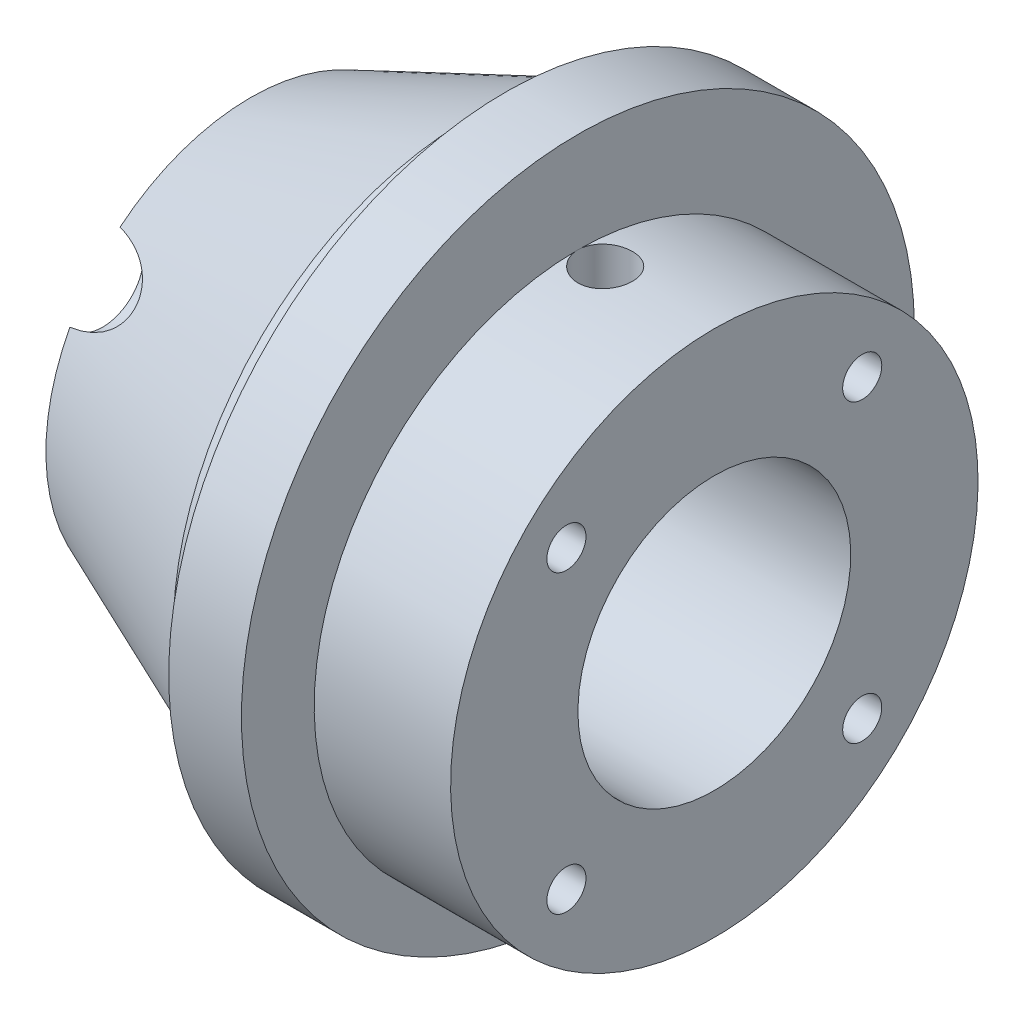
ISO-10303-21;
HEADER;
FILE_DESCRIPTION(('STEP AP214'),'2;1');
FILE_NAME('part.step','',(''),(''),'','','');
FILE_SCHEMA(('AUTOMOTIVE_DESIGN { 1 0 10303 214 1 1 1 1 }'));
ENDSEC;
DATA;
#1=APPLICATION_CONTEXT('core data for automotive mechanical design processes');
#2=APPLICATION_PROTOCOL_DEFINITION('international standard','automotive_design',2000,#1);
#3=PRODUCT_CONTEXT('',#1,'mechanical');
#4=PRODUCT('Part','Part','',(#3));
#5=PRODUCT_RELATED_PRODUCT_CATEGORY('part','',(#4));
#6=PRODUCT_DEFINITION_FORMATION('','',#4);
#7=PRODUCT_DEFINITION_CONTEXT('part definition',#1,'design');
#8=PRODUCT_DEFINITION('design','',#6,#7);
#9=PRODUCT_DEFINITION_SHAPE('','',#8);
#10=(LENGTH_UNIT() NAMED_UNIT(*) SI_UNIT(.MILLI.,.METRE.));
#11=(NAMED_UNIT(*) PLANE_ANGLE_UNIT() SI_UNIT($,.RADIAN.));
#12=(NAMED_UNIT(*) SI_UNIT($,.STERADIAN.) SOLID_ANGLE_UNIT());
#13=UNCERTAINTY_MEASURE_WITH_UNIT(LENGTH_MEASURE(1.E-05),#10,'distance_accuracy_value','');
#14=(GEOMETRIC_REPRESENTATION_CONTEXT(3) GLOBAL_UNCERTAINTY_ASSIGNED_CONTEXT((#13)) GLOBAL_UNIT_ASSIGNED_CONTEXT((#10,
#11,#12)) REPRESENTATION_CONTEXT('',''));
#15=CARTESIAN_POINT('',(0.,0.,0.));
#16=DIRECTION('',(0.,0.,1.));
#17=DIRECTION('',(1.,0.,0.));
#18=AXIS2_PLACEMENT_3D('',#15,#16,#17);
#19=CARTESIAN_POINT('',(10.,0.,0.));
#20=DIRECTION('',(1.,0.,0.));
#21=DIRECTION('',(0.,1.,0.));
#22=AXIS2_PLACEMENT_3D('',#19,#20,#21);
#23=CYLINDRICAL_SURFACE('',#22,29.);
#24=CARTESIAN_POINT('',(0.,0.,0.));
#25=DIRECTION('',(1.,0.,0.));
#26=DIRECTION('',(0.,1.,0.));
#27=AXIS2_PLACEMENT_3D('',#24,#25,#26);
#28=CIRCLE('',#27,29.);
#29=CARTESIAN_POINT('',(0.,29.,0.));
#30=VERTEX_POINT('',#29);
#31=EDGE_CURVE('E317',#30,#30,#28,.T.);
#32=ORIENTED_EDGE('',*,*,#31,.F.);
#33=EDGE_LOOP('',(#32));
#34=FACE_BOUND('',#33,.T.);
#35=CARTESIAN_POINT('',(-15.,0.,0.));
#36=DIRECTION('',(1.,0.,0.));
#37=DIRECTION('',(0.,0.,-1.));
#38=AXIS2_PLACEMENT_3D('',#35,#36,#37);
#39=CIRCLE('',#38,29.);
#40=CARTESIAN_POINT('',(-15.,29.,0.));
#41=VERTEX_POINT('',#40);
#42=EDGE_CURVE('E320',#41,#41,#39,.F.);
#43=ORIENTED_EDGE('',*,*,#42,.F.);
#44=CARTESIAN_POINT('',(-15.,29.,0.));
#45=CARTESIAN_POINT('',(-14.9999927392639,28.9999980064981,-0.168029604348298));
#46=CARTESIAN_POINT('',(-14.9858354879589,28.9985241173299,-0.336169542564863));
#47=CARTESIAN_POINT('',(-14.9295743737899,28.9927862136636,-0.667785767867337));
#48=CARTESIAN_POINT('',(-14.8874399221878,28.9885191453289,-0.831256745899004));
#49=CARTESIAN_POINT('',(-14.7764660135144,28.9776764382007,-1.14868506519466));
#50=CARTESIAN_POINT('',(-14.7076429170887,28.9711022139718,-1.302648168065));
#51=CARTESIAN_POINT('',(-14.5452776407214,28.9563798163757,-1.59680447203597));
#52=CARTESIAN_POINT('',(-14.451740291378,28.948231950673,-1.73700035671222));
#53=CARTESIAN_POINT('',(-14.2422166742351,28.931239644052,-2.00021362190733));
#54=CARTESIAN_POINT('',(-14.1261548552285,28.9223929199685,-2.12317072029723));
#55=CARTESIAN_POINT('',(-13.8750381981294,28.9050187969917,-2.34789784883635));
#56=CARTESIAN_POINT('',(-13.7399824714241,28.8964914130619,-2.44966688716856));
#57=CARTESIAN_POINT('',(-13.454332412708,28.8806982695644,-2.62934409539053));
#58=CARTESIAN_POINT('',(-13.3037034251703,28.8734354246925,-2.70719744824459));
#59=CARTESIAN_POINT('',(-12.9914226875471,28.8610222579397,-2.83648328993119));
#60=CARTESIAN_POINT('',(-12.8297712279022,28.8558718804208,-2.88791647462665));
#61=CARTESIAN_POINT('',(-12.500650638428,28.8482876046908,-2.96272263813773));
#62=CARTESIAN_POINT('',(-12.3332045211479,28.845844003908,-2.98619586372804));
#63=CARTESIAN_POINT('',(-11.9967328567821,28.843919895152,-3.00472571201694));
#64=CARTESIAN_POINT('',(-11.8277073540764,28.8444393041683,-2.99978313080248));
#65=CARTESIAN_POINT('',(-11.4935669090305,28.8483736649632,-2.96170424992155));
#66=CARTESIAN_POINT('',(-11.3284393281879,28.8517773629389,-2.92867752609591));
#67=CARTESIAN_POINT('',(-11.0060834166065,28.8610792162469,-2.83553842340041));
#68=CARTESIAN_POINT('',(-10.8488551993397,28.8669774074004,-2.77542565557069));
#69=CARTESIAN_POINT('',(-10.5464157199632,28.8806165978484,-2.62970029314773));
#70=CARTESIAN_POINT('',(-10.4012279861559,28.888361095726,-2.54403920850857));
#71=CARTESIAN_POINT('',(-10.1272483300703,28.9048173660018,-2.34968363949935));
#72=CARTESIAN_POINT('',(-9.99845692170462,28.9135291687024,-2.24098843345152));
#73=CARTESIAN_POINT('',(-9.76028918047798,28.9309885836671,-2.0030386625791));
#74=CARTESIAN_POINT('',(-9.65100734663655,28.9397361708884,-1.87368948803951));
#75=CARTESIAN_POINT('',(-9.45569372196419,28.9562427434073,-1.59843170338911));
#76=CARTESIAN_POINT('',(-9.36966196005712,28.9640017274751,-1.45252307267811));
#77=CARTESIAN_POINT('',(-9.22329391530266,28.9776596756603,-1.14822178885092));
#78=CARTESIAN_POINT('',(-9.16296256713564,28.9835582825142,-0.989826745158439));
#79=CARTESIAN_POINT('',(-9.06977790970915,28.9928272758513,-0.665080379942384));
#80=CARTESIAN_POINT('',(-9.0369237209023,28.9961977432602,-0.498729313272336));
#81=CARTESIAN_POINT('',(-8.99974619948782,29.0000202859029,-0.163611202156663));
#82=CARTESIAN_POINT('',(-8.9952924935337,29.0004856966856,0.00514123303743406));
#83=CARTESIAN_POINT('',(-9.01469973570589,28.9984814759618,0.340990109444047));
#84=CARTESIAN_POINT('',(-9.03856027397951,28.9960118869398,0.508086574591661));
#85=CARTESIAN_POINT('',(-9.11381051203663,28.9884236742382,0.835502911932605));
#86=CARTESIAN_POINT('',(-9.16513902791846,28.983310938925,0.995836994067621));
#87=CARTESIAN_POINT('',(-9.29380522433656,28.9710098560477,1.30561932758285));
#88=CARTESIAN_POINT('',(-9.37114352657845,28.96382145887,1.45506731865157));
#89=CARTESIAN_POINT('',(-9.54995628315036,28.9481395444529,1.73942375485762));
#90=CARTESIAN_POINT('',(-9.65151622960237,28.9396414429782,1.87427818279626));
#91=CARTESIAN_POINT('',(-9.87576698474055,28.9223080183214,2.12507233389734));
#92=CARTESIAN_POINT('',(-9.99845836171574,28.9134726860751,2.2410115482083));
#93=CARTESIAN_POINT('',(-10.2620587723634,28.8964203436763,2.45113809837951));
#94=CARTESIAN_POINT('',(-10.4030362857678,28.8882058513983,2.54523976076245));
#95=CARTESIAN_POINT('',(-10.698870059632,28.8733639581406,2.70843068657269));
#96=CARTESIAN_POINT('',(-10.8537261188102,28.8667365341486,2.77752031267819));
#97=CARTESIAN_POINT('',(-11.1726295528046,28.8558350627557,2.88858312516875));
#98=CARTESIAN_POINT('',(-11.3366591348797,28.8515566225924,2.93060695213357));
#99=CARTESIAN_POINT('',(-11.6694929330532,28.8458240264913,2.98650943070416));
#100=CARTESIAN_POINT('',(-11.8382970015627,28.8443697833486,3.00038895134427));
#101=CARTESIAN_POINT('',(-12.1750364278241,28.8444521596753,2.99959628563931));
#102=CARTESIAN_POINT('',(-12.3429721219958,28.8459746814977,2.98505867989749));
#103=CARTESIAN_POINT('',(-12.6740016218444,28.8518089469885,2.92812695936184));
#104=CARTESIAN_POINT('',(-12.8370954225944,28.8561206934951,2.88573281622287));
#105=CARTESIAN_POINT('',(-13.1538083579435,28.8670436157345,2.77432920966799));
#106=CARTESIAN_POINT('',(-13.3074290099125,28.8736544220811,2.7053240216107));
#107=CARTESIAN_POINT('',(-13.6009295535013,28.88843132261,2.54267087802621));
#108=CARTESIAN_POINT('',(-13.7408094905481,28.8965974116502,2.44902300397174));
#109=CARTESIAN_POINT('',(-14.0035475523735,28.9136111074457,2.23923796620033));
#110=CARTESIAN_POINT('',(-14.1263253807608,28.922461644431,2.12300047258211));
#111=CARTESIAN_POINT('',(-14.3506909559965,28.9398203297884,1.87153638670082));
#112=CARTESIAN_POINT('',(-14.4522736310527,28.9483283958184,1.73630526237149));
#113=CARTESIAN_POINT('',(-14.6315817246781,28.9640673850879,1.45029401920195));
#114=CARTESIAN_POINT('',(-14.7092426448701,28.9712948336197,1.29947330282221));
#115=CARTESIAN_POINT('',(-14.8380323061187,28.9836209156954,0.986952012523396));
#116=CARTESIAN_POINT('',(-14.889190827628,28.9887219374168,0.825263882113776));
#117=CARTESIAN_POINT('',(-14.9508302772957,28.9949451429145,0.55222483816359));
#118=CARTESIAN_POINT('',(-14.9692435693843,28.9968318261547,0.442616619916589));
#119=CARTESIAN_POINT('',(-14.993830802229,28.9993599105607,0.222021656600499));
#120=CARTESIAN_POINT('',(-15.0000047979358,29.0000013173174,0.1110349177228));
#121=CARTESIAN_POINT('',(-15.,29.,0.));
#122=B_SPLINE_CURVE_WITH_KNOTS('',3,(#44,#45,#46,#47,#48,#49,#50,#51,#52,#53,#54,#55,#56,#57,
#58,#59,#60,#61,#62,#63,#64,#65,#66,#67,#68,#69,#70,#71,#72,#73,#74,#75,#76,#77,#78,#79,#80,#81,
#82,#83,#84,#85,#86,#87,#88,#89,#90,#91,#92,#93,#94,#95,#96,#97,#98,#99,#100,#101,#102,#103,
#104,#105,#106,#107,#108,#109,#110,#111,#112,#113,#114,#115,#116,#117,#118,#119,#120,#121),
.UNSPECIFIED.,.T.,.F.,(4,2,2,2,2,2,2,2,2,2,2,2,2,2,2,2,2,2,2,2,2,2,2,2,2,2,2,2,2,2,2,2,2,2,2,2,
2,2,4),(0.,0.503683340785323,1.00791829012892,1.51184462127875,2.01567252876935,
2.52122052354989,3.02679217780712,3.53351414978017,4.04022277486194,4.54510914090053,
5.04998136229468,5.55289271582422,6.05581129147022,6.55969053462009,7.06358556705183,
7.56985875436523,8.0761325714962,8.5825035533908,9.08885832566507,9.59288697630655,
10.0969083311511,10.5998116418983,11.1027269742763,11.6074443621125,12.1121753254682,
12.6188541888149,13.1255257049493,13.631246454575,14.1369515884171,14.6402675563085,
15.1435840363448,15.6468196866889,16.1500536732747,16.6555760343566,17.1612192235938,
17.6682140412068,18.1746379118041,18.5074762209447,18.8403130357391),.UNSPECIFIED.);
#123=EDGE_CURVE('E50',#41,#41,#122,.T.);
#124=ORIENTED_EDGE('',*,*,#123,.T.);
#125=EDGE_LOOP('',(#43,#124));
#126=FACE_BOUND('',#125,.T.);
#127=ADVANCED_FACE('F31',(#34,#126),#23,.T.);
#128=CARTESIAN_POINT('',(2.99999999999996,0.,0.));
#129=DIRECTION('',(1.,0.,0.));
#130=DIRECTION('',(0.,1.,0.));
#131=AXIS2_PLACEMENT_3D('',#128,#129,#130);
#132=CYLINDRICAL_SURFACE('',#131,15.);
#133=CARTESIAN_POINT('',(-25.,0.,0.));
#134=DIRECTION('',(1.,0.,0.));
#135=DIRECTION('',(0.,1.,0.));
#136=AXIS2_PLACEMENT_3D('',#133,#134,#135);
#137=CIRCLE('',#136,15.);
#138=CARTESIAN_POINT('',(-25.,15.,0.));
#139=VERTEX_POINT('',#138);
#140=EDGE_CURVE('E161',#139,#139,#137,.T.);
#141=ORIENTED_EDGE('',*,*,#140,.F.);
#142=EDGE_LOOP('',(#141));
#143=FACE_BOUND('',#142,.T.);
#144=CARTESIAN_POINT('',(0.,0.,0.));
#145=DIRECTION('',(1.,0.,0.));
#146=DIRECTION('',(0.,1.,0.));
#147=AXIS2_PLACEMENT_3D('',#144,#145,#146);
#148=CIRCLE('',#147,15.);
#149=CARTESIAN_POINT('',(0.,15.,0.));
#150=VERTEX_POINT('',#149);
#151=EDGE_CURVE('E160',#150,#150,#148,.T.);
#152=ORIENTED_EDGE('',*,*,#151,.T.);
#153=EDGE_LOOP('',(#152));
#154=FACE_BOUND('',#153,.T.);
#155=CARTESIAN_POINT('',(-15.,15.,0.));
#156=CARTESIAN_POINT('',(-14.999993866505,14.9999969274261,-0.1667307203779));
#157=CARTESIAN_POINT('',(-14.9860534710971,14.9971915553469,-0.333538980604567));
#158=CARTESIAN_POINT('',(-14.9307044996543,14.9862709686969,-0.662440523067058));
#159=CARTESIAN_POINT('',(-14.8892741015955,14.9781515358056,-0.824529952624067));
#160=CARTESIAN_POINT('',(-14.7802761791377,14.9575094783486,-1.13919091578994));
#161=CARTESIAN_POINT('',(-14.712733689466,14.9449910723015,-1.2917714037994));
#162=CARTESIAN_POINT('',(-14.5535032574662,14.9169119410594,-1.58342396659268));
#163=CARTESIAN_POINT('',(-14.4618167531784,14.9013513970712,-1.72249684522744));
#164=CARTESIAN_POINT('',(-14.2555845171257,14.8686649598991,-1.98508043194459));
#165=CARTESIAN_POINT('',(-14.1407749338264,14.8515223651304,-2.10838185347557));
#166=CARTESIAN_POINT('',(-13.8921227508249,14.8177254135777,-2.33411026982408));
#167=CARTESIAN_POINT('',(-13.7582786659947,14.8010710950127,-2.43653563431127));
#168=CARTESIAN_POINT('',(-13.4738514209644,14.7699732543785,-2.61849526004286));
#169=CARTESIAN_POINT('',(-13.323127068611,14.7555512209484,-2.6978128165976));
#170=CARTESIAN_POINT('',(-13.0101545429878,14.7307880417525,-2.82991699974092));
#171=CARTESIAN_POINT('',(-12.847907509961,14.7204464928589,-2.88270624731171));
#172=CARTESIAN_POINT('',(-12.5187469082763,14.7051841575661,-2.95957589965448));
#173=CARTESIAN_POINT('',(-12.3519223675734,14.7001941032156,-2.98402349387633));
#174=CARTESIAN_POINT('',(-12.016470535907,14.6959912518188,-3.00465638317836));
#175=CARTESIAN_POINT('',(-11.8478434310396,14.6967778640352,-3.0008445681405));
#176=CARTESIAN_POINT('',(-11.516259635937,14.7039765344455,-2.96536371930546));
#177=CARTESIAN_POINT('',(-11.3532557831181,14.7103035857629,-2.93411562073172));
#178=CARTESIAN_POINT('',(-11.034851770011,14.7277363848,-2.84531365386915));
#179=CARTESIAN_POINT('',(-10.879451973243,14.7388423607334,-2.78775852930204));
#180=CARTESIAN_POINT('',(-10.5794542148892,14.7646685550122,-2.64757435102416));
#181=CARTESIAN_POINT('',(-10.4349363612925,14.7794126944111,-2.56477845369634));
#182=CARTESIAN_POINT('',(-10.1616874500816,14.8108385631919,-2.37658072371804));
#183=CARTESIAN_POINT('',(-10.0329582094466,14.827520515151,-2.27117629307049));
#184=CARTESIAN_POINT('',(-9.79251179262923,14.8613106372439,-2.03849980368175));
#185=CARTESIAN_POINT('',(-9.68114229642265,14.8784210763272,-1.91086848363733));
#186=CARTESIAN_POINT('',(-9.48133846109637,14.9108654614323,-1.63855507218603));
#187=CARTESIAN_POINT('',(-9.3929044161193,14.9261993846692,-1.49387276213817));
#188=CARTESIAN_POINT('',(-9.24141747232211,14.9534007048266,-1.19117816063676));
#189=CARTESIAN_POINT('',(-9.17840431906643,14.9652626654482,-1.0331454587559));
#190=CARTESIAN_POINT('',(-9.07991857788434,14.9841422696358,-0.708446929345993));
#191=CARTESIAN_POINT('',(-9.04444265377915,14.9911605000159,-0.541782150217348));
#192=CARTESIAN_POINT('',(-9.00253063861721,14.999480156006,-0.207538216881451));
#193=CARTESIAN_POINT('',(-8.99561874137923,15.0008752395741,-0.0400209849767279));
#194=CARTESIAN_POINT('',(-9.00974957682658,14.9980515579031,0.293774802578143));
#195=CARTESIAN_POINT('',(-9.03079073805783,14.9938331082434,0.460053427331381));
#196=CARTESIAN_POINT('',(-9.09983512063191,14.9803149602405,0.785116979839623));
#197=CARTESIAN_POINT('',(-9.14759420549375,14.9710612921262,0.94395584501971));
#198=CARTESIAN_POINT('',(-9.26845194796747,14.948506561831,1.251370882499));
#199=CARTESIAN_POINT('',(-9.34155250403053,14.9352051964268,1.39994628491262));
#200=CARTESIAN_POINT('',(-9.51204747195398,14.9057973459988,1.68462352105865));
#201=CARTESIAN_POINT('',(-9.60972834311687,14.8896585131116,1.82055038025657));
#202=CARTESIAN_POINT('',(-9.82622757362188,14.8564420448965,2.07425405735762));
#203=CARTESIAN_POINT('',(-9.94504819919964,14.8393643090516,2.19202892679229));
#204=CARTESIAN_POINT('',(-10.2026200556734,14.805879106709,2.40792177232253));
#205=CARTESIAN_POINT('',(-10.341647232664,14.7894858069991,2.50571310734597));
#206=CARTESIAN_POINT('',(-10.6344340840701,14.7595257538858,2.67655626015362));
#207=CARTESIAN_POINT('',(-10.7881931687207,14.7459588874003,2.74960906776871));
#208=CARTESIAN_POINT('',(-11.1053047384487,14.7233022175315,2.86845552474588));
#209=CARTESIAN_POINT('',(-11.268602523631,14.7141892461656,2.91439049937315));
#210=CARTESIAN_POINT('',(-11.6008003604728,14.7014231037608,2.97812595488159));
#211=CARTESIAN_POINT('',(-11.7696996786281,14.6977692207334,2.99593010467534));
#212=CARTESIAN_POINT('',(-12.105026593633,14.6963744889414,3.00276273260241));
#213=CARTESIAN_POINT('',(-12.2714434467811,14.698527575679,2.99230736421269));
#214=CARTESIAN_POINT('',(-12.6000949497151,14.7082672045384,2.94405691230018));
#215=CARTESIAN_POINT('',(-12.7623296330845,14.7158537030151,2.90626204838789));
#216=CARTESIAN_POINT('',(-13.0776831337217,14.7355579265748,2.80463570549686));
#217=CARTESIAN_POINT('',(-13.2308230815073,14.7476646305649,2.74086752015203));
#218=CARTESIAN_POINT('',(-13.5243111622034,14.7750514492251,2.58916393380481));
#219=CARTESIAN_POINT('',(-13.6646582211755,14.7903318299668,2.50122650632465));
#220=CARTESIAN_POINT('',(-13.931146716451,14.8226688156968,2.30191774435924));
#221=CARTESIAN_POINT('',(-14.0570062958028,14.839751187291,2.19017366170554));
#222=CARTESIAN_POINT('',(-14.2883586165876,14.8735824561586,1.94719310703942));
#223=CARTESIAN_POINT('',(-14.3938466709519,14.8903312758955,1.81595216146));
#224=CARTESIAN_POINT('',(-14.5825039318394,14.9218149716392,1.53605288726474));
#225=CARTESIAN_POINT('',(-14.6654280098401,14.9365269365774,1.3872266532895));
#226=CARTESIAN_POINT('',(-14.8049583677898,14.96205375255,1.0774990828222));
#227=CARTESIAN_POINT('',(-14.8615883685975,14.9728721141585,0.916608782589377));
#228=CARTESIAN_POINT('',(-14.9359558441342,14.9872911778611,0.629464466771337));
#229=CARTESIAN_POINT('',(-14.9599295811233,14.9920290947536,0.504844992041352));
#230=CARTESIAN_POINT('',(-14.9919537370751,14.9983846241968,0.2534985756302));
#231=CARTESIAN_POINT('',(-15.0000046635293,15.0000023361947,0.126771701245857));
#232=CARTESIAN_POINT('',(-15.,15.,0.));
#233=B_SPLINE_CURVE_WITH_KNOTS('',3,(#155,#156,#157,#158,#159,#160,#161,#162,#163,#164,#165,
#166,#167,#168,#169,#170,#171,#172,#173,#174,#175,#176,#177,#178,#179,#180,#181,#182,#183,#184,
#185,#186,#187,#188,#189,#190,#191,#192,#193,#194,#195,#196,#197,#198,#199,#200,#201,#202,#203,
#204,#205,#206,#207,#208,#209,#210,#211,#212,#213,#214,#215,#216,#217,#218,#219,#220,#221,#222,
#223,#224,#225,#226,#227,#228,#229,#230,#231,#232),.UNSPECIFIED.,.T.,.F.,(4,2,2,2,2,2,2,2,2,2,2,
2,2,2,2,2,2,2,2,2,2,2,2,2,2,2,2,2,2,2,2,2,2,2,2,2,2,2,4),(0.,0.499728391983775,0.99985395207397,
1.49950120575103,1.99911870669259,2.50479801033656,3.0105167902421,3.52083585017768,
4.03110448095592,4.53468555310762,5.03821512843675,5.53415181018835,6.03011217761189,
6.52942470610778,7.02879464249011,7.53714757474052,8.04550702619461,8.55465824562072,
9.06374777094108,9.56432207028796,10.064868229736,10.5609136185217,11.0569961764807,
11.5591519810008,12.0613616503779,12.5712188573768,13.081055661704,13.5882114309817,
14.0953010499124,14.593191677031,15.0910783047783,15.5877588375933,16.084481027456,
16.5896422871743,17.0949196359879,17.6054849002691,18.1155886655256,18.4955632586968,
18.8755257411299),.UNSPECIFIED.);
#234=CARTESIAN_POINT('',(-15.,15.,0.));
#235=VERTEX_POINT('',#234);
#236=EDGE_CURVE('E35',#235,#235,#233,.T.);
#237=ORIENTED_EDGE('',*,*,#236,.F.);
#238=EDGE_LOOP('',(#237));
#239=FACE_BOUND('',#238,.T.);
#240=ADVANCED_FACE('F210',(#143,#154,#239),#132,.F.);
#241=CARTESIAN_POINT('',(2.99999999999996,0.,0.));
#242=DIRECTION('',(1.,0.,0.));
#243=DIRECTION('',(0.,1.,0.));
#244=AXIS2_PLACEMENT_3D('',#241,#242,#243);
#245=CYLINDRICAL_SURFACE('',#244,16.);
#246=CARTESIAN_POINT('',(-49.8,0.,0.));
#247=DIRECTION('',(1.,0.,0.));
#248=DIRECTION('',(0.,1.,0.));
#249=AXIS2_PLACEMENT_3D('',#246,#247,#248);
#250=CIRCLE('',#249,15.9999999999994);
#251=CARTESIAN_POINT('',(-49.8,15.9999999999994,0.));
#252=VERTEX_POINT('',#251);
#253=EDGE_CURVE('E179',#252,#252,#250,.T.);
#254=ORIENTED_EDGE('',*,*,#253,.T.);
#255=EDGE_LOOP('',(#254));
#256=FACE_BOUND('',#255,.T.);
#257=CARTESIAN_POINT('',(-51.,0.,0.));
#258=DIRECTION('',(1.,0.,0.));
#259=DIRECTION('',(0.,1.,0.));
#260=AXIS2_PLACEMENT_3D('',#257,#258,#259);
#261=CIRCLE('',#260,16.);
#262=CARTESIAN_POINT('',(-51.,16.,0.));
#263=VERTEX_POINT('',#262);
#264=EDGE_CURVE('E167',#263,#263,#261,.T.);
#265=ORIENTED_EDGE('',*,*,#264,.F.);
#266=EDGE_LOOP('',(#265));
#267=FACE_BOUND('',#266,.T.);
#268=ADVANCED_FACE('F206',(#256,#267),#245,.F.);
#269=CARTESIAN_POINT('',(0.,0.,0.));
#270=DIRECTION('',(1.,0.,0.));
#271=DIRECTION('',(0.,1.,0.));
#272=AXIS2_PLACEMENT_3D('',#269,#270,#271);
#273=PLANE('',#272);
#274=ORIENTED_EDGE('',*,*,#151,.F.);
#275=EDGE_LOOP('',(#274));
#276=FACE_BOUND('',#275,.T.);
#277=CARTESIAN_POINT('',(0.,16.2634559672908,16.2634559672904));
#278=DIRECTION('',(-1.,0.,0.));
#279=DIRECTION('',(0.,0.,-1.));
#280=AXIS2_PLACEMENT_3D('',#277,#278,#279);
#281=CIRCLE('',#280,2.15);
#282=CARTESIAN_POINT('',(0.,16.2634559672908,14.1134559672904));
#283=VERTEX_POINT('',#282);
#284=EDGE_CURVE('E154',#283,#283,#281,.T.);
#285=ORIENTED_EDGE('',*,*,#284,.T.);
#286=EDGE_LOOP('',(#285));
#287=FACE_BOUND('',#286,.T.);
#288=CARTESIAN_POINT('',(0.,-16.2634559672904,16.2634559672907));
#289=DIRECTION('',(-1.,0.,0.));
#290=DIRECTION('',(0.,1.,0.));
#291=AXIS2_PLACEMENT_3D('',#288,#289,#290);
#292=CIRCLE('',#291,2.15);
#293=CARTESIAN_POINT('',(0.,-14.1134559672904,16.2634559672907));
#294=VERTEX_POINT('',#293);
#295=EDGE_CURVE('E148',#294,#294,#292,.T.);
#296=ORIENTED_EDGE('',*,*,#295,.T.);
#297=EDGE_LOOP('',(#296));
#298=FACE_BOUND('',#297,.T.);
#299=CARTESIAN_POINT('',(0.,-16.2634559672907,-16.2634559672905));
#300=DIRECTION('',(-1.,0.,0.));
#301=DIRECTION('',(0.,0.,1.));
#302=AXIS2_PLACEMENT_3D('',#299,#300,#301);
#303=CIRCLE('',#302,2.15);
#304=CARTESIAN_POINT('',(0.,-16.2634559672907,-14.1134559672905));
#305=VERTEX_POINT('',#304);
#306=EDGE_CURVE('E101',#305,#305,#303,.T.);
#307=ORIENTED_EDGE('',*,*,#306,.T.);
#308=EDGE_LOOP('',(#307));
#309=FACE_BOUND('',#308,.T.);
#310=CARTESIAN_POINT('',(0.,16.2634559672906,-16.2634559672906));
#311=DIRECTION('',(-1.,0.,0.));
#312=DIRECTION('',(0.,-1.,0.));
#313=AXIS2_PLACEMENT_3D('',#310,#311,#312);
#314=CIRCLE('',#313,2.15);
#315=CARTESIAN_POINT('',(0.,14.1134559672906,-16.2634559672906));
#316=VERTEX_POINT('',#315);
#317=EDGE_CURVE('E123',#316,#316,#314,.T.);
#318=ORIENTED_EDGE('',*,*,#317,.T.);
#319=EDGE_LOOP('',(#318));
#320=FACE_BOUND('',#319,.T.);
#321=ORIENTED_EDGE('',*,*,#31,.T.);
#322=EDGE_LOOP('',(#321));
#323=FACE_BOUND('',#322,.T.);
#324=ADVANCED_FACE('F351',(#276,#287,#298,#309,#320,#323),#273,.T.);
#325=CARTESIAN_POINT('',(-15.,3.,0.));
#326=DIRECTION('',(1.,0.,0.));
#327=DIRECTION('',(0.,0.,-1.));
#328=AXIS2_PLACEMENT_3D('',#325,#326,#327);
#329=PLANE('',#328);
#330=ORIENTED_EDGE('',*,*,#42,.T.);
#331=EDGE_LOOP('',(#330));
#332=FACE_BOUND('',#331,.T.);
#333=CARTESIAN_POINT('',(-15.,3.,0.));
#334=DIRECTION('',(1.,0.,0.));
#335=DIRECTION('',(0.,0.,-1.));
#336=AXIS2_PLACEMENT_3D('',#333,#334,#335);
#337=CIRCLE('',#336,37.);
#338=CARTESIAN_POINT('',(-15.,3.,-37.));
#339=VERTEX_POINT('',#338);
#340=EDGE_CURVE('E322',#339,#339,#337,.T.);
#341=ORIENTED_EDGE('',*,*,#340,.T.);
#342=EDGE_LOOP('',(#341));
#343=FACE_BOUND('',#342,.T.);
#344=ADVANCED_FACE('F346',(#332,#343),#329,.T.);
#345=CARTESIAN_POINT('',(-51.,3.,0.));
#346=DIRECTION('',(1.,0.,0.));
#347=DIRECTION('',(0.,0.,-1.));
#348=AXIS2_PLACEMENT_3D('',#345,#346,#347);
#349=CYLINDRICAL_SURFACE('',#348,37.);
#350=CARTESIAN_POINT('',(-23.,3.,0.));
#351=DIRECTION('',(1.,0.,0.));
#352=DIRECTION('',(0.,0.,-1.));
#353=AXIS2_PLACEMENT_3D('',#350,#351,#352);
#354=CIRCLE('',#353,37.);
#355=CARTESIAN_POINT('',(-23.,3.,-37.));
#356=VERTEX_POINT('',#355);
#357=EDGE_CURVE('E325',#356,#356,#354,.T.);
#358=ORIENTED_EDGE('',*,*,#357,.T.);
#359=EDGE_LOOP('',(#358));
#360=FACE_BOUND('',#359,.T.);
#361=ORIENTED_EDGE('',*,*,#340,.F.);
#362=EDGE_LOOP('',(#361));
#363=FACE_BOUND('',#362,.T.);
#364=ADVANCED_FACE('F341',(#360,#363),#349,.T.);
#365=CARTESIAN_POINT('',(-23.,40.,0.));
#366=DIRECTION('',(-1.,0.,0.));
#367=DIRECTION('',(0.,0.,1.));
#368=AXIS2_PLACEMENT_3D('',#365,#366,#367);
#369=PLANE('',#368);
#370=CARTESIAN_POINT('',(-23.,3.,0.));
#371=DIRECTION('',(1.,0.,0.));
#372=DIRECTION('',(0.,0.,-1.));
#373=AXIS2_PLACEMENT_3D('',#370,#371,#372);
#374=CIRCLE('',#373,32.5);
#375=CARTESIAN_POINT('',(-23.,3.,-32.5));
#376=VERTEX_POINT('',#375);
#377=EDGE_CURVE('E112',#376,#376,#374,.T.);
#378=ORIENTED_EDGE('',*,*,#377,.T.);
#379=EDGE_LOOP('',(#378));
#380=FACE_BOUND('',#379,.T.);
#381=ORIENTED_EDGE('',*,*,#357,.F.);
#382=EDGE_LOOP('',(#381));
#383=FACE_BOUND('',#382,.T.);
#384=ADVANCED_FACE('F333',(#380,#383),#369,.T.);
#385=CARTESIAN_POINT('',(-51.,3.,0.));
#386=DIRECTION('',(1.,0.,0.));
#387=DIRECTION('',(0.,0.,-1.));
#388=AXIS2_PLACEMENT_3D('',#385,#386,#387);
#389=CYLINDRICAL_SURFACE('',#388,32.5);
#390=CARTESIAN_POINT('',(-27.,3.,0.));
#391=DIRECTION('',(1.,0.,0.));
#392=DIRECTION('',(0.,0.,-1.));
#393=AXIS2_PLACEMENT_3D('',#390,#391,#392);
#394=CIRCLE('',#393,32.5);
#395=CARTESIAN_POINT('',(-27.,3.,-32.5));
#396=VERTEX_POINT('',#395);
#397=EDGE_CURVE('E108',#396,#396,#394,.T.);
#398=ORIENTED_EDGE('',*,*,#397,.T.);
#399=EDGE_LOOP('',(#398));
#400=FACE_BOUND('',#399,.T.);
#401=ORIENTED_EDGE('',*,*,#377,.F.);
#402=EDGE_LOOP('',(#401));
#403=FACE_BOUND('',#402,.T.);
#404=ADVANCED_FACE('F248',(#400,#403),#389,.T.);
#405=CARTESIAN_POINT('',(-27.,3.,0.));
#406=DIRECTION('',(1.,0.,0.));
#407=DIRECTION('',(0.,0.,-1.));
#408=AXIS2_PLACEMENT_3D('',#405,#406,#407);
#409=CONICAL_SURFACE('',#408,32.5,0.394791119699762);
#410=CARTESIAN_POINT('',(-51.0002,13.5654746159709,19.864969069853));
#411=CARTESIAN_POINT('',(-50.7837048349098,13.6452507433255,19.9247044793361));
#412=CARTESIAN_POINT('',(-50.5677283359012,13.7279281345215,19.9825281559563));
#413=CARTESIAN_POINT('',(-50.1370323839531,13.8994760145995,20.0938753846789));
#414=CARTESIAN_POINT('',(-49.9223134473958,13.9883488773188,20.1473972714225));
#415=CARTESIAN_POINT('',(-49.4920209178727,14.1736936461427,20.250214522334));
#416=CARTESIAN_POINT('',(-49.2764666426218,14.2702421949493,20.2994532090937));
#417=CARTESIAN_POINT('',(-48.8474960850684,14.4704773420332,20.392306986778));
#418=CARTESIAN_POINT('',(-48.6340795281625,14.574163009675,20.4359228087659));
#419=CARTESIAN_POINT('',(-48.1975994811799,14.795505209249,20.5190290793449));
#420=CARTESIAN_POINT('',(-47.974695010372,14.9136233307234,20.5581331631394));
#421=CARTESIAN_POINT('',(-47.5327065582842,15.1594043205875,20.6277886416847));
#422=CARTESIAN_POINT('',(-47.3136238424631,15.2870702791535,20.6583372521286));
#423=CARTESIAN_POINT('',(-46.8817524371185,15.5523274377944,20.7089534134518));
#424=CARTESIAN_POINT('',(-46.6689381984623,15.6898670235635,20.7290715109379));
#425=CARTESIAN_POINT('',(-46.2505902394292,15.9766522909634,20.7566196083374));
#426=CARTESIAN_POINT('',(-46.0450503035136,16.1258876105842,20.7640607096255));
#427=CARTESIAN_POINT('',(-45.7383653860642,16.3645608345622,20.7630777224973));
#428=CARTESIAN_POINT('',(-45.6334688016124,16.4492188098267,20.760457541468));
#429=CARTESIAN_POINT('',(-45.4272793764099,16.6226149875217,20.7499425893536));
#430=CARTESIAN_POINT('',(-45.3259878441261,16.7113546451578,20.7420459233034));
#431=CARTESIAN_POINT('',(-45.1286375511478,16.8925558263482,20.7201933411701));
#432=CARTESIAN_POINT('',(-45.032549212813,16.984989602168,20.706276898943));
#433=CARTESIAN_POINT('',(-44.8462365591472,17.1742675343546,20.6713665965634));
#434=CARTESIAN_POINT('',(-44.756009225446,17.2711093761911,20.6503764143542));
#435=CARTESIAN_POINT('',(-44.5614119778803,17.4941809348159,20.5937787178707));
#436=CARTESIAN_POINT('',(-44.4591520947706,17.6217010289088,20.5558278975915));
#437=CARTESIAN_POINT('',(-44.2712655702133,17.8833378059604,20.464067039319));
#438=CARTESIAN_POINT('',(-44.1856231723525,18.0174480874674,20.4102721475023));
#439=CARTESIAN_POINT('',(-44.0544683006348,18.2591885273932,20.2983711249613));
#440=CARTESIAN_POINT('',(-44.0042608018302,18.3659549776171,20.2439856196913));
#441=CARTESIAN_POINT('',(-43.9216003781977,18.5797786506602,20.1234629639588));
#442=CARTESIAN_POINT('',(-43.8891282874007,18.6868354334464,20.057338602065));
#443=CARTESIAN_POINT('',(-43.8449450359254,18.8987259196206,19.9133671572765));
#444=CARTESIAN_POINT('',(-43.8334006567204,19.0035352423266,19.8354312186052));
#445=CARTESIAN_POINT('',(-43.8329966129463,19.2059251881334,19.6706384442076));
#446=CARTESIAN_POINT('',(-43.8441331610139,19.303507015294,19.5837831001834));
#447=CARTESIAN_POINT('',(-43.8851881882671,19.4775906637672,19.4150192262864));
#448=CARTESIAN_POINT('',(-43.9127992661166,19.5552261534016,19.3336906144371));
#449=CARTESIAN_POINT('',(-43.9824415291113,19.7013758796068,19.1691121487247));
#450=CARTESIAN_POINT('',(-44.0244793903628,19.7698858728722,19.0858614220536));
#451=CARTESIAN_POINT('',(-44.1465199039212,19.9325608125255,18.8738196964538));
#452=CARTESIAN_POINT('',(-44.2347310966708,20.0203836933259,18.7449135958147));
#453=CARTESIAN_POINT('',(-44.4309177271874,20.1766516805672,18.4904170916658));
#454=CARTESIAN_POINT('',(-44.5389484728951,20.2450411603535,18.3648371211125));
#455=CARTESIAN_POINT('',(-44.7527223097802,20.3572085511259,18.1356487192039));
#456=CARTESIAN_POINT('',(-44.8567225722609,20.403080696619,18.0314003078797));
#457=CARTESIAN_POINT('',(-45.072300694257,20.4846293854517,17.8267357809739));
#458=CARTESIAN_POINT('',(-45.1838843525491,20.5202980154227,17.7263226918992));
#459=CARTESIAN_POINT('',(-45.4129096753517,20.5830110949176,17.5292173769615));
#460=CARTESIAN_POINT('',(-45.5303611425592,20.6100405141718,17.432531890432));
#461=CARTESIAN_POINT('',(-45.7696962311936,20.6566632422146,17.2428769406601));
#462=CARTESIAN_POINT('',(-45.8915815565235,20.6762536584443,17.149908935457));
#463=CARTESIAN_POINT('',(-46.1427233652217,20.7095179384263,16.9646472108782));
#464=CARTESIAN_POINT('',(-46.2720910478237,20.7229848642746,16.8724680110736));
#465=CARTESIAN_POINT('',(-46.5337798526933,20.7439582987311,16.6916717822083));
#466=CARTESIAN_POINT('',(-46.6661016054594,20.7514635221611,16.6030555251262));
#467=CARTESIAN_POINT('',(-47.0668302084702,20.7661521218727,16.3421109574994));
#468=CARTESIAN_POINT('',(-47.3388228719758,20.7654872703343,16.1748159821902));
#469=CARTESIAN_POINT('',(-47.8897066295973,20.7475197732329,15.8520014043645));
#470=CARTESIAN_POINT('',(-48.1686100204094,20.730185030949,15.696505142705));
#471=CARTESIAN_POINT('',(-48.7309005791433,20.681773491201,15.3965493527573));
#472=CARTESIAN_POINT('',(-49.014285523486,20.6507033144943,15.2520845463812));
#473=CARTESIAN_POINT('',(-49.5809571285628,20.5773863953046,14.9749341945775));
#474=CARTESIAN_POINT('',(-49.8642025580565,20.5352810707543,14.8421261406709));
#475=CARTESIAN_POINT('',(-50.290038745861,20.4648832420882,14.6501965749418));
#476=CARTESIAN_POINT('',(-50.4317066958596,20.4402975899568,14.5876158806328));
#477=CARTESIAN_POINT('',(-50.7155711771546,20.3888369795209,14.4646594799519));
#478=CARTESIAN_POINT('',(-50.8577676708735,20.3619621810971,14.4042836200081));
#479=CARTESIAN_POINT('',(-51.0002,20.3340120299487,14.3449739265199));
#480=B_SPLINE_CURVE_WITH_KNOTS('',3,(#410,#411,#412,#413,#414,#415,#416,#417,#418,#419,#420,
#421,#422,#423,#424,#425,#426,#427,#428,#429,#430,#431,#432,#433,#434,#435,#436,#437,#438,#439,
#440,#441,#442,#443,#444,#445,#446,#447,#448,#449,#450,#451,#452,#453,#454,#455,#456,#457,#458,
#459,#460,#461,#462,#463,#464,#465,#466,#467,#468,#469,#470,#471,#472,#473,#474,#475,#476,#477,
#478,#479),.UNSPECIFIED.,.F.,.F.,(4,2,2,2,2,2,2,2,2,2,2,2,2,2,2,2,2,2,2,2,2,2,2,2,2,2,2,2,2,2,2,
2,2,2,4),(0.,0.715004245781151,1.43028397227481,2.15391947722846,2.87746080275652,
3.64299662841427,4.4087813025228,5.17081943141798,5.93218989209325,6.33648741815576,
6.74093021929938,7.1427602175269,7.54438160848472,8.04649216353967,8.54812427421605,
8.93641105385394,9.3242773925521,9.71522143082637,10.1061001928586,10.4520242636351,
10.7981086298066,11.3326311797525,11.8686686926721,12.3307099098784,12.7931084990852,
13.2563072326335,13.7196858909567,14.1977340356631,14.6758852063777,15.632846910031,
16.5916548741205,17.5500011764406,18.4966203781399,18.967034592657,19.4374159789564),.UNSPECIFIED.);
#481=CARTESIAN_POINT('',(-51.,13.5655482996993,19.8650242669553));
#482=VERTEX_POINT('',#481);
#483=CARTESIAN_POINT('',(-51.,20.3340512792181,14.3450572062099));
#484=VERTEX_POINT('',#483);
#485=EDGE_CURVE('E11',#482,#484,#480,.T.);
#486=ORIENTED_EDGE('',*,*,#485,.F.);
#487=CARTESIAN_POINT('',(-51.,3.,0.));
#488=DIRECTION('',(1.,0.,0.));
#489=DIRECTION('',(0.,0.,-1.));
#490=AXIS2_PLACEMENT_3D('',#487,#488,#489);
#491=CIRCLE('',#490,22.5);
#492=CARTESIAN_POINT('',(-51.,-11.813868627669,16.9351497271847));
#493=VERTEX_POINT('',#492);
#494=EDGE_CURVE('E99',#482,#493,#491,.T.);
#495=ORIENTED_EDGE('',*,*,#494,.T.);
#496=CARTESIAN_POINT('',(-35.9998,-16.9389272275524,20.7124714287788));
#497=CARTESIAN_POINT('',(-36.1395000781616,-16.8393152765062,20.7275569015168));
#498=CARTESIAN_POINT('',(-36.2810916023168,-16.7419006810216,20.738962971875));
#499=CARTESIAN_POINT('',(-36.5673139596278,-16.5512358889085,20.7552729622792));
#500=CARTESIAN_POINT('',(-36.7119430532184,-16.4579833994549,20.7601805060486));
#501=CARTESIAN_POINT('',(-37.0033087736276,-16.2755183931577,20.7643600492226));
#502=CARTESIAN_POINT('',(-37.1500395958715,-16.1862968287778,20.7636453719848));
#503=CARTESIAN_POINT('',(-37.4455184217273,-16.0114110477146,20.7572436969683));
#504=CARTESIAN_POINT('',(-37.5942667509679,-15.9257474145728,20.7515558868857));
#505=CARTESIAN_POINT('',(-38.0417833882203,-15.6744503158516,20.7279121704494));
#506=CARTESIAN_POINT('',(-38.3430078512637,-15.5137764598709,20.7033835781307));
#507=CARTESIAN_POINT('',(-38.9502091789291,-15.2042788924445,20.6398789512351));
#508=CARTESIAN_POINT('',(-39.2561898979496,-15.0554654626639,20.6008905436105));
#509=CARTESIAN_POINT('',(-39.8867168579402,-14.7616994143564,20.5084060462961));
#510=CARTESIAN_POINT('',(-40.2114306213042,-14.6173052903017,20.4542857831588));
#511=CARTESIAN_POINT('',(-40.8635174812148,-14.3397280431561,20.3343430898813));
#512=CARTESIAN_POINT('',(-41.1908910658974,-14.2065470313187,20.268518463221));
#513=CARTESIAN_POINT('',(-41.8476693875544,-13.950734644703,20.1264511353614));
#514=CARTESIAN_POINT('',(-42.1770750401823,-13.8281084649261,20.0502033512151));
#515=CARTESIAN_POINT('',(-42.8371632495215,-13.5930497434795,19.8882724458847));
#516=CARTESIAN_POINT('',(-43.1678457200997,-13.4806165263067,19.8025899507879));
#517=CARTESIAN_POINT('',(-43.8317254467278,-13.2651122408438,19.6219970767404));
#518=CARTESIAN_POINT('',(-44.1649269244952,-13.1620918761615,19.5270418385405));
#519=CARTESIAN_POINT('',(-44.8317472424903,-12.9659357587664,19.328715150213));
#520=CARTESIAN_POINT('',(-45.1653660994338,-12.8728004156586,19.2253433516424));
#521=CARTESIAN_POINT('',(-45.832420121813,-12.6964979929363,19.0104751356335));
#522=CARTESIAN_POINT('',(-46.1658552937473,-12.6133258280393,18.8989829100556));
#523=CARTESIAN_POINT('',(-46.8322458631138,-12.4571072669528,18.6678618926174));
#524=CARTESIAN_POINT('',(-47.1652013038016,-12.3840598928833,18.5482338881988));
#525=CARTESIAN_POINT('',(-47.7935887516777,-12.2559565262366,18.3142426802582));
#526=CARTESIAN_POINT('',(-48.0891206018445,-12.1998054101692,18.200747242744));
#527=CARTESIAN_POINT('',(-48.6789141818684,-12.0963425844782,17.9668411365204));
#528=CARTESIAN_POINT('',(-48.9731762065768,-12.0490287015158,17.8464321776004));
#529=CARTESIAN_POINT('',(-49.5577271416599,-11.9642552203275,17.5990648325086));
#530=CARTESIAN_POINT('',(-49.8480292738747,-11.9267238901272,17.4721627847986));
#531=CARTESIAN_POINT('',(-50.2816324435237,-11.8782490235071,17.2756362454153));
#532=CARTESIAN_POINT('',(-50.4258952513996,-11.8633916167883,17.2090806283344));
#533=CARTESIAN_POINT('',(-50.7136568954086,-11.8364759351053,17.0737605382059));
#534=CARTESIAN_POINT('',(-50.8571556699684,-11.8244178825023,17.0049958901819));
#535=CARTESIAN_POINT('',(-51.0002,-11.813853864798,16.9350519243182));
#536=B_SPLINE_CURVE_WITH_KNOTS('',3,(#496,#497,#498,#499,#500,#501,#502,#503,#504,#505,#506,
#507,#508,#509,#510,#511,#512,#513,#514,#515,#516,#517,#518,#519,#520,#521,#522,#523,#524,#525,
#526,#527,#528,#529,#530,#531,#532,#533,#534,#535),.UNSPECIFIED.,.F.,.F.,(4,2,2,2,2,2,2,2,2,2,2,
2,2,2,2,2,2,2,2,4),(0.,0.516566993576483,1.03284581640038,1.54790154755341,2.06304142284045,
3.08914959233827,4.11613782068,5.1941139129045,6.27229251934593,7.35099879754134,
8.42963353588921,9.51377262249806,10.5979566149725,11.6815848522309,12.7651083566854,
13.7294754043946,14.6936049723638,15.6504522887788,16.1291215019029,16.6078287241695),.UNSPECIFIED.);
#537=CARTESIAN_POINT('',(-36.,-16.9387845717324,20.7124930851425));
#538=VERTEX_POINT('',#537);
#539=EDGE_CURVE('E44',#538,#493,#536,.T.);
#540=ORIENTED_EDGE('',*,*,#539,.F.);
#541=CARTESIAN_POINT('',(-36.,3.,0.));
#542=DIRECTION('',(-1.,0.,0.));
#543=DIRECTION('',(0.,-1.,0.));
#544=AXIS2_PLACEMENT_3D('',#541,#542,#543);
#545=CIRCLE('',#544,28.75);
#546=CARTESIAN_POINT('',(-36.,-20.762739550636,16.1831612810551));
#547=VERTEX_POINT('',#546);
#548=EDGE_CURVE('E278',#538,#547,#545,.F.);
#549=ORIENTED_EDGE('',*,*,#548,.T.);
#550=CARTESIAN_POINT('',(-51.0002,-16.1793867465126,11.7642413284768));
#551=CARTESIAN_POINT('',(-50.8436435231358,-16.2567890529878,11.7628065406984));
#552=CARTESIAN_POINT('',(-50.6865420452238,-16.3331042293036,11.7633672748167));
#553=CARTESIAN_POINT('',(-50.3714410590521,-16.4837007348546,11.7682146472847));
#554=CARTESIAN_POINT('',(-50.2134416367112,-16.5579822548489,11.7725009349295));
#555=CARTESIAN_POINT('',(-49.8967680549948,-16.7046381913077,11.7845317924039));
#556=CARTESIAN_POINT('',(-49.7380941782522,-16.777013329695,11.7922750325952));
#557=CARTESIAN_POINT('',(-49.4201419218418,-16.9199948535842,11.8110235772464));
#558=CARTESIAN_POINT('',(-49.2608635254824,-16.9906011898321,11.822028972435));
#559=CARTESIAN_POINT('',(-48.7823905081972,-17.199862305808,11.859678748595));
#560=CARTESIAN_POINT('',(-48.4624517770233,-17.3360082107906,11.8909609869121));
#561=CARTESIAN_POINT('',(-47.8212937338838,-17.602087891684,11.9649538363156));
#562=CARTESIAN_POINT('',(-47.5000742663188,-17.7320208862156,12.0076658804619));
#563=CARTESIAN_POINT('',(-46.8496708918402,-17.9887623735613,12.1050202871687));
#564=CARTESIAN_POINT('',(-46.5204702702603,-18.1154349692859,12.1599092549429));
#565=CARTESIAN_POINT('',(-45.8617780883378,-18.3625916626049,12.2806751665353));
#566=CARTESIAN_POINT('',(-45.5322865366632,-18.4830759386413,12.3465517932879));
#567=CARTESIAN_POINT('',(-44.8734090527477,-18.7177546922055,12.4891649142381));
#568=CARTESIAN_POINT('',(-44.5440231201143,-18.8319491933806,12.5659013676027));
#569=CARTESIAN_POINT('',(-43.8857878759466,-19.0537577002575,12.730290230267));
#570=CARTESIAN_POINT('',(-43.5569385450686,-19.1613719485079,12.8179422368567));
#571=CARTESIAN_POINT('',(-42.7543177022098,-19.4158321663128,13.0457978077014));
#572=CARTESIAN_POINT('',(-42.2810223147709,-19.5588848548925,13.1920560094));
#573=CARTESIAN_POINT('',(-41.5737045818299,-19.7608727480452,13.4299312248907));
#574=CARTESIAN_POINT('',(-41.3383338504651,-19.8261125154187,13.5123182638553));
#575=CARTESIAN_POINT('',(-40.8687160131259,-19.9519949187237,13.683537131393));
#576=CARTESIAN_POINT('',(-40.6344688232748,-20.012637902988,13.7723684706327));
#577=CARTESIAN_POINT('',(-40.1693951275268,-20.1283514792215,13.9560202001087));
#578=CARTESIAN_POINT('',(-39.9385565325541,-20.1834655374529,14.0507824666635));
#579=CARTESIAN_POINT('',(-39.478650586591,-20.2881101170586,14.2473804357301));
#580=CARTESIAN_POINT('',(-39.2495830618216,-20.3376411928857,14.3492154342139));
#581=CARTESIAN_POINT('',(-38.7938206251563,-20.4303427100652,14.5604139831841));
#582=CARTESIAN_POINT('',(-38.5671241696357,-20.473517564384,14.6697722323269));
#583=CARTESIAN_POINT('',(-38.1166209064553,-20.5525626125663,14.8967108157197));
#584=CARTESIAN_POINT('',(-37.8928138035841,-20.5884335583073,15.0142903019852));
#585=CARTESIAN_POINT('',(-37.3845830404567,-20.6607810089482,15.2938813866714));
#586=CARTESIAN_POINT('',(-37.1013697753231,-20.6944260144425,15.458901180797));
#587=CARTESIAN_POINT('',(-36.6829379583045,-20.7313471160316,15.7196979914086));
#588=CARTESIAN_POINT('',(-36.5442768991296,-20.7414023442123,15.8090175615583));
#589=CARTESIAN_POINT('',(-36.2697625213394,-20.7562259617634,15.992465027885));
#590=CARTESIAN_POINT('',(-36.1339110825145,-20.7609909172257,16.0865960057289));
#591=CARTESIAN_POINT('',(-35.9998,-20.7627421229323,16.1833055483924));
#592=B_SPLINE_CURVE_WITH_KNOTS('',3,(#550,#551,#552,#553,#554,#555,#556,#557,#558,#559,#560,
#561,#562,#563,#564,#565,#566,#567,#568,#569,#570,#571,#572,#573,#574,#575,#576,#577,#578,#579,
#580,#581,#582,#583,#584,#585,#586,#587,#588,#589,#590,#591),.UNSPECIFIED.,.F.,.F.,(4,2,2,2,2,2,
2,2,2,2,2,2,2,2,2,2,2,2,2,2,4),(0.,0.523924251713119,1.04779918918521,1.57147280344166,
2.09516098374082,3.14218626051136,4.18934287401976,5.26003917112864,6.33070457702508,
7.40136595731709,8.47198784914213,10.0179187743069,10.7911202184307,11.5642630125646,
12.3307518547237,13.0971645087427,13.863042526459,14.6288416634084,15.6163569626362,
16.1119362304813,16.6078369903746),.UNSPECIFIED.);
#593=CARTESIAN_POINT('',(-51.,-16.1794856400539,11.7642394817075));
#594=VERTEX_POINT('',#593);
#595=EDGE_CURVE('E274',#594,#547,#592,.T.);
#596=ORIENTED_EDGE('',*,*,#595,.F.);
#597=CARTESIAN_POINT('',(-51.,-16.179485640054,-11.7642394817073));
#598=VERTEX_POINT('',#597);
#599=EDGE_CURVE('E114',#594,#598,#491,.T.);
#600=ORIENTED_EDGE('',*,*,#599,.T.);
#601=CARTESIAN_POINT('',(-35.9998000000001,-20.7627421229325,-16.183305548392));
#602=CARTESIAN_POINT('',(-36.1395000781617,-20.7609100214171,-16.0825744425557));
#603=CARTESIAN_POINT('',(-36.281091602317,-20.7558190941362,-15.9846265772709));
#604=CARTESIAN_POINT('',(-36.567313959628,-20.7399254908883,-15.7939266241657));
#605=CARTESIAN_POINT('',(-36.7119430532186,-20.7291260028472,-15.701171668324));
#606=CARTESIAN_POINT('',(-37.0033087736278,-20.7026487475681,-15.5205895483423));
#607=CARTESIAN_POINT('',(-37.1500395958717,-20.6869825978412,-15.4327512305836));
#608=CARTESIAN_POINT('',(-37.4455184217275,-20.6513449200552,-15.2614153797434));
#609=CARTESIAN_POINT('',(-37.5942667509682,-20.631372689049,-15.1779185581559));
#610=CARTESIAN_POINT('',(-38.0417833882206,-20.5659236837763,-14.9341447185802));
#611=CARTESIAN_POINT('',(-38.3430078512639,-20.5147989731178,-14.7798592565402));
#612=CARTESIAN_POINT('',(-38.9502091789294,-20.4002938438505,-14.4853933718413));
#613=CARTESIAN_POINT('',(-39.25618989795,-20.3369029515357,-14.3452251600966));
#614=CARTESIAN_POINT('',(-39.8867168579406,-20.1964663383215,-14.0711276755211));
#615=CARTESIAN_POINT('',(-40.2114306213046,-20.1188989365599,-13.9378536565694));
#616=CARTESIAN_POINT('',(-40.8635174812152,-19.9541076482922,-13.6843202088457));
#617=CARTESIAN_POINT('',(-41.1908910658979,-19.8668819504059,-13.5640632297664));
#618=CARTESIAN_POINT('',(-41.8476693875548,-19.6839290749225,-13.3356965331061));
#619=CARTESIAN_POINT('',(-42.1770750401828,-19.5881977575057,-13.2275927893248));
#620=CARTESIAN_POINT('',(-42.837163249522,-19.3891427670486,-13.0230168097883));
#621=CARTESIAN_POINT('',(-43.1678457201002,-19.2858195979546,-12.9265438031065));
#622=CARTESIAN_POINT('',(-43.8317254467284,-19.0716459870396,-12.7443747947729));
#623=CARTESIAN_POINT('',(-44.1649269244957,-18.9607598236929,-12.6587363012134));
#624=CARTESIAN_POINT('',(-44.8317472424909,-18.7323480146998,-12.4986152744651));
#625=CARTESIAN_POINT('',(-45.1653660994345,-18.6148220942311,-12.4241332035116));
#626=CARTESIAN_POINT('',(-45.8324201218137,-18.3734322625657,-12.2863585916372));
#627=CARTESIAN_POINT('',(-46.1658552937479,-18.2495716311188,-12.2230603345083));
#628=CARTESIAN_POINT('',(-46.8322458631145,-17.9955270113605,-12.1078106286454));
#629=CARTESIAN_POINT('',(-47.1652013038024,-17.8653436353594,-12.0558580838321));
#630=CARTESIAN_POINT('',(-47.7935887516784,-17.6131841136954,-11.9688067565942));
#631=CARTESIAN_POINT('',(-48.0891206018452,-17.4918798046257,-11.9324828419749));
#632=CARTESIAN_POINT('',(-48.6789141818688,-17.2439361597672,-11.8697088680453));
#633=CARTESIAN_POINT('',(-48.9731762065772,-17.1172981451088,-11.8432563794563));
#634=CARTESIAN_POINT('',(-49.5577271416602,-16.8592178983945,-11.8011644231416));
#635=CARTESIAN_POINT('',(-49.848029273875,-16.7278191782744,-11.7854447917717));
#636=CARTESIAN_POINT('',(-50.2816324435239,-16.5259467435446,-11.7706119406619));
#637=CARTESIAN_POINT('',(-50.4258952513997,-16.4578421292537,-11.7671256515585));
#638=CARTESIAN_POINT('',(-50.7136568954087,-16.3199247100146,-11.7632829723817));
#639=CARTESIAN_POINT('',(-50.8571556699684,-16.2501117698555,-11.7629268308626));
#640=CARTESIAN_POINT('',(-51.0002,-16.1793867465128,-11.7642413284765));
#641=B_SPLINE_CURVE_WITH_KNOTS('',3,(#601,#602,#603,#604,#605,#606,#607,#608,#609,#610,#611,
#612,#613,#614,#615,#616,#617,#618,#619,#620,#621,#622,#623,#624,#625,#626,#627,#628,#629,#630,
#631,#632,#633,#634,#635,#636,#637,#638,#639,#640),.UNSPECIFIED.,.F.,.F.,(4,2,2,2,2,2,2,2,2,2,2,
2,2,2,2,2,2,2,2,4),(0.,0.516566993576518,1.03284581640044,1.54790154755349,2.06304142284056,
3.08914959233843,4.11613782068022,5.19411391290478,6.27229251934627,7.35099879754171,
8.42963353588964,9.51377262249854,10.597956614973,11.6815848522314,12.765108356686,
13.7294754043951,14.693604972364,15.6504522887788,16.1291215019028,16.6078287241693),.UNSPECIFIED.);
#642=CARTESIAN_POINT('',(-36.,-20.7627395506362,-16.1831612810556));
#643=VERTEX_POINT('',#642);
#644=EDGE_CURVE('E269',#643,#598,#641,.T.);
#645=ORIENTED_EDGE('',*,*,#644,.F.);
#646=CARTESIAN_POINT('',(-36.,3.,0.));
#647=DIRECTION('',(-1.,0.,0.));
#648=DIRECTION('',(0.,0.,1.));
#649=AXIS2_PLACEMENT_3D('',#646,#647,#648);
#650=CIRCLE('',#649,28.75);
#651=CARTESIAN_POINT('',(-36.,-16.9387845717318,-20.7124930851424));
#652=VERTEX_POINT('',#651);
#653=EDGE_CURVE('E376',#643,#652,#650,.F.);
#654=ORIENTED_EDGE('',*,*,#653,.T.);
#655=CARTESIAN_POINT('',(-51.0002,-11.8138538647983,-16.9350519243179));
#656=CARTESIAN_POINT('',(-50.8436435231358,-11.8254190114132,-17.0115987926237));
#657=CARTESIAN_POINT('',(-50.6865420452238,-11.8387691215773,-17.0867392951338));
#658=CARTESIAN_POINT('',(-50.3714410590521,-11.8688014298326,-17.2343904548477));
#659=CARTESIAN_POINT('',(-50.2134416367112,-11.8854833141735,-17.3069013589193));
#660=CARTESIAN_POINT('',(-49.8967680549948,-11.9219365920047,-17.4494631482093));
#661=CARTESIAN_POINT('',(-49.7380941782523,-11.9417067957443,-17.5195149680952));
#662=CARTESIAN_POINT('',(-49.4201419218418,-11.9841664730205,-17.6573278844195));
#663=CARTESIAN_POINT('',(-49.2608635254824,-12.0068560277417,-17.725088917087));
#664=CARTESIAN_POINT('',(-48.7823905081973,-12.0790637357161,-17.9250733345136));
#665=CARTESIAN_POINT('',(-48.4624517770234,-12.1327333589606,-18.0540456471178));
#666=CARTESIAN_POINT('',(-47.8212937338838,-12.2502974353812,-18.303949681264));
#667=CARTESIAN_POINT('',(-47.5000742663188,-12.3141931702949,-18.4248803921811));
#668=CARTESIAN_POINT('',(-46.8496708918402,-12.4532220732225,-18.6616609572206));
#669=CARTESIAN_POINT('',(-46.5204702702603,-12.5285755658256,-18.7773354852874));
#670=CARTESIAN_POINT('',(-45.8617780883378,-12.689077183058,-19.0007410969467));
#671=CARTESIAN_POINT('',(-45.5322865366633,-12.7742250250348,-19.1084724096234));
#672=CARTESIAN_POINT('',(-44.8734090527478,-12.9541720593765,-19.3159132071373));
#673=CARTESIAN_POINT('',(-44.5440231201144,-13.0489712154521,-19.4156227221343));
#674=CARTESIAN_POINT('',(-43.8857878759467,-13.2482274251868,-19.6067239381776));
#675=CARTESIAN_POINT('',(-43.5569385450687,-13.3526841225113,-19.6981159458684));
#676=CARTESIAN_POINT('',(-42.7543177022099,-13.6199837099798,-19.9107637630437));
#677=CARTESIAN_POINT('',(-42.281022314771,-13.7881594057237,-20.0272647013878));
#678=CARTESIAN_POINT('',(-41.5737045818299,-14.0565376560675,-20.1865030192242));
#679=CARTESIAN_POINT('',(-41.3383338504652,-14.1486981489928,-20.2370034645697));
#680=CARTESIAN_POINT('',(-40.8687160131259,-14.3386017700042,-20.3323915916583));
#681=CARTESIAN_POINT('',(-40.6344688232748,-14.4363444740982,-20.3772796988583));
#682=CARTESIAN_POINT('',(-40.1693951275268,-14.6367996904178,-20.460558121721));
#683=CARTESIAN_POINT('',(-39.9385565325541,-14.7394621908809,-20.4990010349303));
#684=CARTESIAN_POINT('',(-39.478650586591,-14.9508241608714,-20.5691962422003));
#685=CARTESIAN_POINT('',(-39.2495830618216,-15.0595230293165,-20.6009492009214));
#686=CARTESIAN_POINT('',(-38.7938206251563,-15.2832760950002,-20.6569220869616));
#687=CARTESIAN_POINT('',(-38.5671241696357,-15.3983258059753,-20.6811472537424));
#688=CARTESIAN_POINT('',(-38.1166209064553,-15.6353059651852,-20.7210175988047));
#689=CARTESIAN_POINT('',(-37.8928138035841,-15.7572357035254,-20.7366636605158));
#690=CARTESIAN_POINT('',(-37.3845830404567,-16.0449996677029,-20.7611019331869));
#691=CARTESIAN_POINT('',(-37.1013697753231,-16.2133246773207,-20.7665982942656));
#692=CARTESIAN_POINT('',(-36.6829379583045,-16.4766198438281,-20.7592634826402));
#693=CARTESIAN_POINT('',(-36.5442768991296,-16.5663607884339,-20.7541982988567));
#694=CARTESIAN_POINT('',(-36.2697625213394,-16.7496963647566,-20.7380496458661));
#695=CARTESIAN_POINT('',(-36.1339110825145,-16.84329345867,-20.7269622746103));
#696=CARTESIAN_POINT('',(-35.9998,-16.9389272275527,-20.7124714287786));
#697=B_SPLINE_CURVE_WITH_KNOTS('',3,(#655,#656,#657,#658,#659,#660,#661,#662,#663,#664,#665,
#666,#667,#668,#669,#670,#671,#672,#673,#674,#675,#676,#677,#678,#679,#680,#681,#682,#683,#684,
#685,#686,#687,#688,#689,#690,#691,#692,#693,#694,#695,#696),.UNSPECIFIED.,.F.,.F.,(4,2,2,2,2,2,
2,2,2,2,2,2,2,2,2,2,2,2,2,2,4),(0.,0.523924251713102,1.04779918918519,1.57147280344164,
2.0951609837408,3.14218626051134,4.18934287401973,5.2600391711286,6.33070457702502,
7.40136595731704,8.47198784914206,10.0179187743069,10.7911202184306,11.5642630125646,
12.3307518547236,13.0971645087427,13.863042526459,14.6288416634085,15.6163569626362,
16.1119362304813,16.6078369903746),.UNSPECIFIED.);
#698=CARTESIAN_POINT('',(-51.,-11.8138686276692,-16.9351497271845));
#699=VERTEX_POINT('',#698);
#700=EDGE_CURVE('E261',#699,#652,#697,.T.);
#701=ORIENTED_EDGE('',*,*,#700,.F.);
#702=CARTESIAN_POINT('',(-51.,13.565548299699,-19.8650242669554));
#703=VERTEX_POINT('',#702);
#704=EDGE_CURVE('E110',#699,#703,#491,.T.);
#705=ORIENTED_EDGE('',*,*,#704,.T.);
#706=CARTESIAN_POINT('',(-51.0002,20.3340120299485,-14.3449739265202));
#707=CARTESIAN_POINT('',(-50.7837048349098,20.3764815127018,-14.4351342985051));
#708=CARTESIAN_POINT('',(-50.5677283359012,20.4164948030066,-14.5277521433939));
#709=CARTESIAN_POINT('',(-50.1370323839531,20.4910635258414,-14.7181894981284));
#710=CARTESIAN_POINT('',(-49.9223134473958,20.5256168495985,-14.8160109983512));
#711=CARTESIAN_POINT('',(-49.4920209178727,20.5890549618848,-15.0182476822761));
#712=CARTESIAN_POINT('',(-49.2764666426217,20.6178688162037,-15.1227265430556));
#713=CARTESIAN_POINT('',(-48.8474960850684,20.668552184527,-15.3375453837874));
#714=CARTESIAN_POINT('',(-48.6340795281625,20.6904226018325,-15.4478845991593));
#715=CARTESIAN_POINT('',(-48.1975994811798,20.7273124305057,-15.6814186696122));
#716=CARTESIAN_POINT('',(-47.9746950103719,20.7418605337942,-15.8049879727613));
#717=CARTESIAN_POINT('',(-47.5327065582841,20.760659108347,-16.0597560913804));
#718=CARTESIAN_POINT('',(-47.313623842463,20.7649062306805,-16.1909573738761));
#719=CARTESIAN_POINT('',(-46.8817524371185,20.7611373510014,-16.4609743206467));
#720=CARTESIAN_POINT('',(-46.6689381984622,20.7531812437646,-16.5997495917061));
#721=CARTESIAN_POINT('',(-46.2505902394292,20.7224857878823,-16.886215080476));
#722=CARTESIAN_POINT('',(-46.0450503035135,20.6997593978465,-17.0338973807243));
#723=CARTESIAN_POINT('',(-45.7383653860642,20.6507925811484,-17.2674955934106));
#724=CARTESIAN_POINT('',(-45.6334688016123,20.6311988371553,-17.3498965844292));
#725=CARTESIAN_POINT('',(-45.4272793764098,20.5860238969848,-17.5176345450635));
#726=CARTESIAN_POINT('',(-45.325987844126,20.5604405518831,-17.6029725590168));
#727=CARTESIAN_POINT('',(-45.1286375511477,20.5025898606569,-17.776075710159));
#728=CARTESIAN_POINT('',(-45.0325492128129,20.4703667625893,-17.8638216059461));
#729=CARTESIAN_POINT('',(-44.8462365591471,20.3981007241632,-18.0422101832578));
#730=CARTESIAN_POINT('',(-44.7560092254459,20.3580618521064,-18.1328513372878));
#731=CARTESIAN_POINT('',(-44.5614119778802,20.2577547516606,-18.3399810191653));
#732=CARTESIAN_POINT('',(-44.4591520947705,20.1949315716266,-18.4572622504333));
#733=CARTESIAN_POINT('',(-44.2712655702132,20.0524233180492,-18.695096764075));
#734=CARTESIAN_POINT('',(-44.1856231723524,19.9727543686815,-18.8156468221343));
#735=CARTESIAN_POINT('',(-44.0544683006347,19.8145192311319,-19.0299408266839));
#736=CARTESIAN_POINT('',(-44.0042608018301,19.7397713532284,-19.1235870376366));
#737=CARTESIAN_POINT('',(-43.9216003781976,19.5787056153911,-19.3088007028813));
#738=CARTESIAN_POINT('',(-43.8891282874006,19.4924003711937,-19.4003702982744));
#739=CARTESIAN_POINT('',(-43.8449450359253,19.3087538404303,-19.578974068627));
#740=CARTESIAN_POINT('',(-43.8334006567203,19.2113304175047,-19.6659664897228));
#741=CARTESIAN_POINT('',(-43.8329966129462,19.0091988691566,-19.8310761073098));
#742=CARTESIAN_POINT('',(-43.8441331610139,18.9044919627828,-19.9091947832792));
#743=CARTESIAN_POINT('',(-43.885188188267,18.7041636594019,-20.045777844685));
#744=CARTESIAN_POINT('',(-43.9127992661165,18.6088823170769,-20.1054693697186));
#745=CARTESIAN_POINT('',(-43.9824415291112,18.4182721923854,-20.2155311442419));
#746=CARTESIAN_POINT('',(-44.0244793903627,18.3229434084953,-20.2658970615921));
#747=CARTESIAN_POINT('',(-44.1465199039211,18.0825162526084,-20.3826001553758));
#748=CARTESIAN_POINT('',(-44.2347310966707,17.9385806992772,-20.4427017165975));
#749=CARTESIAN_POINT('',(-44.4309177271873,17.6578549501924,-20.5445899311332));
#750=CARTESIAN_POINT('',(-44.538948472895,17.5210861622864,-20.5863241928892));
#751=CARTESIAN_POINT('',(-44.7527223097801,17.2740212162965,-20.6501031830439));
#752=CARTESIAN_POINT('',(-44.8567225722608,17.1626769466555,-20.6740706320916));
#753=CARTESIAN_POINT('',(-45.0723006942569,16.9457930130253,-20.7127890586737));
#754=CARTESIAN_POINT('',(-45.1838843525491,16.8402579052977,-20.7275328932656));
#755=CARTESIAN_POINT('',(-45.4129096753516,16.6345670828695,-20.7493209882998));
#756=CARTESIAN_POINT('',(-45.530361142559,16.5344209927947,-20.756351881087));
#757=CARTESIAN_POINT('',(-45.7696962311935,16.3392645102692,-20.7638769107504));
#758=CARTESIAN_POINT('',(-45.8915815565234,16.244256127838,-20.7643685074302));
#759=CARTESIAN_POINT('',(-46.1427233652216,16.0560898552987,-20.7596916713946));
#760=CARTESIAN_POINT('',(-46.2720910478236,15.963085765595,-20.754343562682));
#761=CARTESIAN_POINT('',(-46.5337798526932,15.781765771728,-20.7385251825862));
#762=CARTESIAN_POINT('',(-46.6661016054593,15.6934508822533,-20.7280538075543));
#763=CARTESIAN_POINT('',(-47.0668302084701,15.4348844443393,-20.68995893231));
#764=CARTESIAN_POINT('',(-47.3388228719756,15.2711418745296,-20.6556599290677));
#765=CARTESIAN_POINT('',(-47.8897066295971,14.9585378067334,-20.5731324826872));
#766=CARTESIAN_POINT('',(-48.1686100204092,14.8097056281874,-20.5248772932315));
#767=CARTESIAN_POINT('',(-48.7309005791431,14.5256163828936,-20.4171254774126));
#768=CARTESIAN_POINT('',(-49.0142855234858,14.3903528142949,-20.3576342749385));
#769=CARTESIAN_POINT('',(-49.5809571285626,14.1336121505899,-20.2300728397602));
#770=CARTESIAN_POINT('',(-49.8642025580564,14.0119866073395,-20.1621164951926));
#771=CARTESIAN_POINT('',(-50.290038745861,13.8381381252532,-20.054554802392));
#772=CARTESIAN_POINT('',(-50.4317066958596,13.7817811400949,-20.0178848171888));
#773=CARTESIAN_POINT('',(-50.7155711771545,13.6716875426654,-19.9427458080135));
#774=CARTESIAN_POINT('',(-50.8577676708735,13.6179507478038,-19.9042769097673));
#775=CARTESIAN_POINT('',(-51.0002,13.5654746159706,-19.8649690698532));
#776=B_SPLINE_CURVE_WITH_KNOTS('',3,(#706,#707,#708,#709,#710,#711,#712,#713,#714,#715,#716,
#717,#718,#719,#720,#721,#722,#723,#724,#725,#726,#727,#728,#729,#730,#731,#732,#733,#734,#735,
#736,#737,#738,#739,#740,#741,#742,#743,#744,#745,#746,#747,#748,#749,#750,#751,#752,#753,#754,
#755,#756,#757,#758,#759,#760,#761,#762,#763,#764,#765,#766,#767,#768,#769,#770,#771,#772,#773,
#774,#775),.UNSPECIFIED.,.F.,.F.,(4,2,2,2,2,2,2,2,2,2,2,2,2,2,2,2,2,2,2,2,2,2,2,2,2,2,2,2,2,2,2,
2,2,2,4),(0.,0.71500424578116,1.43028397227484,2.1539194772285,2.87746080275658,
3.64299662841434,4.40878130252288,5.17081943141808,5.93218989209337,6.33648741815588,
6.7409302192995,7.14276021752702,7.54438160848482,8.04649216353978,8.54812427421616,
8.93641105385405,9.3242773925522,9.71522143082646,10.1061001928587,10.4520242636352,
10.7981086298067,11.3326311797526,11.8686686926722,12.3307099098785,12.7931084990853,
13.2563072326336,13.7196858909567,14.1977340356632,14.6758852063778,15.632846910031,
16.5916548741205,17.5500011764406,18.4966203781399,18.9670345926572,19.4374159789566),.UNSPECIFIED.);
#777=CARTESIAN_POINT('',(-51.,20.3340512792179,-14.3450572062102));
#778=VERTEX_POINT('',#777);
#779=EDGE_CURVE('E107',#778,#703,#776,.T.);
#780=ORIENTED_EDGE('',*,*,#779,.F.);
#781=EDGE_CURVE('E97',#778,#484,#491,.T.);
#782=ORIENTED_EDGE('',*,*,#781,.T.);
#783=EDGE_LOOP('',(#486,#495,#540,#549,#596,#600,#645,#654,#701,#705,#780,#782));
#784=FACE_BOUND('',#783,.T.);
#785=ORIENTED_EDGE('',*,*,#397,.F.);
#786=EDGE_LOOP('',(#785));
#787=FACE_BOUND('',#786,.T.);
#788=ADVANCED_FACE('F104',(#784,#787),#409,.T.);
#789=CARTESIAN_POINT('',(-51.,25.5,0.));
#790=DIRECTION('',(-1.,0.,0.));
#791=DIRECTION('',(0.,0.,1.));
#792=AXIS2_PLACEMENT_3D('',#789,#790,#791);
#793=PLANE('',#792);
#794=ORIENTED_EDGE('',*,*,#264,.T.);
#795=EDGE_LOOP('',(#794));
#796=FACE_BOUND('',#795,.T.);
#797=CARTESIAN_POINT('',(-51.,16.2634559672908,16.2634559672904));
#798=DIRECTION('',(-1.,0.,0.));
#799=DIRECTION('',(0.,0.,-1.));
#800=AXIS2_PLACEMENT_3D('',#797,#798,#799);
#801=CIRCLE('',#800,4.50000000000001);
#802=EDGE_CURVE('E55',#484,#482,#801,.T.);
#803=ORIENTED_EDGE('',*,*,#802,.F.);
#804=ORIENTED_EDGE('',*,*,#781,.F.);
#805=CARTESIAN_POINT('',(-51.,16.2634559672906,-16.2634559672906));
#806=DIRECTION('',(-1.,0.,0.));
#807=DIRECTION('',(0.,-1.,0.));
#808=AXIS2_PLACEMENT_3D('',#805,#806,#807);
#809=CIRCLE('',#808,4.50000000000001);
#810=EDGE_CURVE('E120',#703,#778,#809,.T.);
#811=ORIENTED_EDGE('',*,*,#810,.F.);
#812=ORIENTED_EDGE('',*,*,#704,.F.);
#813=CARTESIAN_POINT('',(-51.,-16.2634559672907,-16.2634559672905));
#814=DIRECTION('',(-1.,0.,0.));
#815=DIRECTION('',(0.,0.,1.));
#816=AXIS2_PLACEMENT_3D('',#813,#814,#815);
#817=CIRCLE('',#816,4.50000000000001);
#818=EDGE_CURVE('E134',#598,#699,#817,.T.);
#819=ORIENTED_EDGE('',*,*,#818,.F.);
#820=ORIENTED_EDGE('',*,*,#599,.F.);
#821=CARTESIAN_POINT('',(-51.,-16.2634559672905,16.2634559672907));
#822=DIRECTION('',(-1.,0.,0.));
#823=DIRECTION('',(0.,1.,0.));
#824=AXIS2_PLACEMENT_3D('',#821,#822,#823);
#825=CIRCLE('',#824,4.50000000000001);
#826=EDGE_CURVE('E139',#493,#594,#825,.T.);
#827=ORIENTED_EDGE('',*,*,#826,.F.);
#828=ORIENTED_EDGE('',*,*,#494,.F.);
#829=EDGE_LOOP('',(#803,#804,#811,#812,#819,#820,#827,#828));
#830=FACE_BOUND('',#829,.T.);
#831=ADVANCED_FACE('F95',(#796,#830),#793,.T.);
#832=CARTESIAN_POINT('',(-36.,16.2634559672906,-16.2634559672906));
#833=DIRECTION('',(-1.,0.,0.));
#834=DIRECTION('',(0.,-1.,0.));
#835=AXIS2_PLACEMENT_3D('',#832,#833,#834);
#836=CYLINDRICAL_SURFACE('',#835,4.50000000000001);
#837=ORIENTED_EDGE('',*,*,#779,.T.);
#838=ORIENTED_EDGE('',*,*,#810,.T.);
#839=EDGE_LOOP('',(#837,#838));
#840=FACE_BOUND('',#839,.T.);
#841=CARTESIAN_POINT('',(-36.,16.2634559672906,-16.2634559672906));
#842=DIRECTION('',(-1.,0.,0.));
#843=DIRECTION('',(0.,-1.,0.));
#844=AXIS2_PLACEMENT_3D('',#841,#842,#843);
#845=CIRCLE('',#844,4.50000000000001);
#846=CARTESIAN_POINT('',(-36.,11.7634559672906,-16.2634559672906));
#847=VERTEX_POINT('',#846);
#848=EDGE_CURVE('E116',#847,#847,#845,.T.);
#849=ORIENTED_EDGE('',*,*,#848,.F.);
#850=EDGE_LOOP('',(#849));
#851=FACE_BOUND('',#850,.T.);
#852=ADVANCED_FACE('F300',(#840,#851),#836,.F.);
#853=CARTESIAN_POINT('',(-36.,16.2634559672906,-16.2634559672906));
#854=DIRECTION('',(-1.,0.,0.));
#855=DIRECTION('',(0.,-1.,0.));
#856=AXIS2_PLACEMENT_3D('',#853,#854,#855);
#857=PLANE('',#856);
#858=CARTESIAN_POINT('',(-36.,16.2634559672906,-16.2634559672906));
#859=DIRECTION('',(-1.,0.,0.));
#860=DIRECTION('',(0.,-1.,0.));
#861=AXIS2_PLACEMENT_3D('',#858,#859,#860);
#862=CIRCLE('',#861,2.15);
#863=CARTESIAN_POINT('',(-36.,14.1134559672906,-16.2634559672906));
#864=VERTEX_POINT('',#863);
#865=EDGE_CURVE('E128',#864,#864,#862,.T.);
#866=ORIENTED_EDGE('',*,*,#865,.F.);
#867=EDGE_LOOP('',(#866));
#868=FACE_BOUND('',#867,.T.);
#869=ORIENTED_EDGE('',*,*,#848,.T.);
#870=EDGE_LOOP('',(#869));
#871=FACE_BOUND('',#870,.T.);
#872=ADVANCED_FACE('F297',(#868,#871),#857,.T.);
#873=CARTESIAN_POINT('',(0.,16.2634559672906,-16.2634559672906));
#874=DIRECTION('',(-1.,0.,0.));
#875=DIRECTION('',(0.,-1.,0.));
#876=AXIS2_PLACEMENT_3D('',#873,#874,#875);
#877=CYLINDRICAL_SURFACE('',#876,2.15);
#878=ORIENTED_EDGE('',*,*,#317,.F.);
#879=EDGE_LOOP('',(#878));
#880=FACE_BOUND('',#879,.T.);
#881=ORIENTED_EDGE('',*,*,#865,.T.);
#882=EDGE_LOOP('',(#881));
#883=FACE_BOUND('',#882,.T.);
#884=ADVANCED_FACE('F292',(#880,#883),#877,.F.);
#885=CARTESIAN_POINT('',(-36.,-16.2634559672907,-16.2634559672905));
#886=DIRECTION('',(-1.,0.,0.));
#887=DIRECTION('',(0.,0.,1.));
#888=AXIS2_PLACEMENT_3D('',#885,#886,#887);
#889=CYLINDRICAL_SURFACE('',#888,4.50000000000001);
#890=ORIENTED_EDGE('',*,*,#644,.T.);
#891=ORIENTED_EDGE('',*,*,#818,.T.);
#892=ORIENTED_EDGE('',*,*,#700,.T.);
#893=CARTESIAN_POINT('',(-36.,-16.2634559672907,-16.2634559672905));
#894=DIRECTION('',(-1.,0.,0.));
#895=DIRECTION('',(0.,0.,1.));
#896=AXIS2_PLACEMENT_3D('',#893,#894,#895);
#897=CIRCLE('',#896,4.50000000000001);
#898=EDGE_CURVE('E131',#643,#652,#897,.T.);
#899=ORIENTED_EDGE('',*,*,#898,.F.);
#900=EDGE_LOOP('',(#890,#891,#892,#899));
#901=FACE_BOUND('',#900,.T.);
#902=ADVANCED_FACE('F287',(#901),#889,.F.);
#903=CARTESIAN_POINT('',(-36.,-16.2634559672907,-16.2634559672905));
#904=DIRECTION('',(-1.,0.,0.));
#905=DIRECTION('',(0.,0.,1.));
#906=AXIS2_PLACEMENT_3D('',#903,#904,#905);
#907=PLANE('',#906);
#908=CARTESIAN_POINT('',(-36.,-16.2634559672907,-16.2634559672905));
#909=DIRECTION('',(-1.,0.,0.));
#910=DIRECTION('',(0.,0.,1.));
#911=AXIS2_PLACEMENT_3D('',#908,#909,#910);
#912=CIRCLE('',#911,2.15);
#913=CARTESIAN_POINT('',(-36.,-16.2634559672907,-14.1134559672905));
#914=VERTEX_POINT('',#913);
#915=EDGE_CURVE('E145',#914,#914,#912,.T.);
#916=ORIENTED_EDGE('',*,*,#915,.F.);
#917=EDGE_LOOP('',(#916));
#918=FACE_BOUND('',#917,.T.);
#919=ORIENTED_EDGE('',*,*,#898,.T.);
#920=ORIENTED_EDGE('',*,*,#653,.F.);
#921=EDGE_LOOP('',(#919,#920));
#922=FACE_BOUND('',#921,.T.);
#923=ADVANCED_FACE('F283',(#918,#922),#907,.T.);
#924=CARTESIAN_POINT('',(-36.,-16.2634559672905,16.2634559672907));
#925=DIRECTION('',(-1.,0.,0.));
#926=DIRECTION('',(0.,-1.,0.));
#927=AXIS2_PLACEMENT_3D('',#924,#925,#926);
#928=CYLINDRICAL_SURFACE('',#927,4.50000000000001);
#929=ORIENTED_EDGE('',*,*,#539,.T.);
#930=ORIENTED_EDGE('',*,*,#826,.T.);
#931=ORIENTED_EDGE('',*,*,#595,.T.);
#932=CARTESIAN_POINT('',(-36.,-16.2634559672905,16.2634559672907));
#933=DIRECTION('',(-1.,0.,0.));
#934=DIRECTION('',(0.,1.,0.));
#935=AXIS2_PLACEMENT_3D('',#932,#933,#934);
#936=CIRCLE('',#935,4.50000000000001);
#937=EDGE_CURVE('E136',#538,#547,#936,.T.);
#938=ORIENTED_EDGE('',*,*,#937,.F.);
#939=EDGE_LOOP('',(#929,#930,#931,#938));
#940=FACE_BOUND('',#939,.T.);
#941=ADVANCED_FACE('F279',(#940),#928,.F.);
#942=CARTESIAN_POINT('',(-36.,-16.2634559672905,16.2634559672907));
#943=DIRECTION('',(-1.,0.,0.));
#944=DIRECTION('',(0.,1.,0.));
#945=AXIS2_PLACEMENT_3D('',#942,#943,#944);
#946=PLANE('',#945);
#947=CARTESIAN_POINT('',(-36.,-16.2634559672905,16.2634559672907));
#948=DIRECTION('',(-1.,0.,0.));
#949=DIRECTION('',(0.,1.,0.));
#950=AXIS2_PLACEMENT_3D('',#947,#948,#949);
#951=CIRCLE('',#950,2.15);
#952=CARTESIAN_POINT('',(-36.,-14.1134559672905,16.2634559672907));
#953=VERTEX_POINT('',#952);
#954=EDGE_CURVE('E151',#953,#953,#951,.T.);
#955=ORIENTED_EDGE('',*,*,#954,.F.);
#956=EDGE_LOOP('',(#955));
#957=FACE_BOUND('',#956,.T.);
#958=ORIENTED_EDGE('',*,*,#937,.T.);
#959=ORIENTED_EDGE('',*,*,#548,.F.);
#960=EDGE_LOOP('',(#958,#959));
#961=FACE_BOUND('',#960,.T.);
#962=ADVANCED_FACE('F233',(#957,#961),#946,.T.);
#963=CARTESIAN_POINT('',(-36.,16.2634559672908,16.2634559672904));
#964=DIRECTION('',(-1.,0.,0.));
#965=DIRECTION('',(0.,0.,1.));
#966=AXIS2_PLACEMENT_3D('',#963,#964,#965);
#967=CYLINDRICAL_SURFACE('',#966,4.50000000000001);
#968=ORIENTED_EDGE('',*,*,#485,.T.);
#969=ORIENTED_EDGE('',*,*,#802,.T.);
#970=EDGE_LOOP('',(#968,#969));
#971=FACE_BOUND('',#970,.T.);
#972=CARTESIAN_POINT('',(-36.,16.2634559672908,16.2634559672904));
#973=DIRECTION('',(-1.,0.,0.));
#974=DIRECTION('',(0.,0.,-1.));
#975=AXIS2_PLACEMENT_3D('',#972,#973,#974);
#976=CIRCLE('',#975,4.50000000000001);
#977=CARTESIAN_POINT('',(-36.,16.2634559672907,11.7634559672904));
#978=VERTEX_POINT('',#977);
#979=EDGE_CURVE('E100',#978,#978,#976,.T.);
#980=ORIENTED_EDGE('',*,*,#979,.F.);
#981=EDGE_LOOP('',(#980));
#982=FACE_BOUND('',#981,.T.);
#983=ADVANCED_FACE('F88',(#971,#982),#967,.F.);
#984=CARTESIAN_POINT('',(-36.,16.2634559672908,16.2634559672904));
#985=DIRECTION('',(-1.,0.,0.));
#986=DIRECTION('',(0.,0.,-1.));
#987=AXIS2_PLACEMENT_3D('',#984,#985,#986);
#988=PLANE('',#987);
#989=CARTESIAN_POINT('',(-36.,16.2634559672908,16.2634559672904));
#990=DIRECTION('',(-1.,0.,0.));
#991=DIRECTION('',(0.,0.,-1.));
#992=AXIS2_PLACEMENT_3D('',#989,#990,#991);
#993=CIRCLE('',#992,2.15);
#994=CARTESIAN_POINT('',(-36.,16.2634559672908,14.1134559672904));
#995=VERTEX_POINT('',#994);
#996=EDGE_CURVE('E157',#995,#995,#993,.T.);
#997=ORIENTED_EDGE('',*,*,#996,.F.);
#998=EDGE_LOOP('',(#997));
#999=FACE_BOUND('',#998,.T.);
#1000=ORIENTED_EDGE('',*,*,#979,.T.);
#1001=EDGE_LOOP('',(#1000));
#1002=FACE_BOUND('',#1001,.T.);
#1003=ADVANCED_FACE('F225',(#999,#1002),#988,.T.);
#1004=CARTESIAN_POINT('',(0.,-16.2634559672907,-16.2634559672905));
#1005=DIRECTION('',(-1.,0.,0.));
#1006=DIRECTION('',(0.,0.,1.));
#1007=AXIS2_PLACEMENT_3D('',#1004,#1005,#1006);
#1008=CYLINDRICAL_SURFACE('',#1007,2.15);
#1009=ORIENTED_EDGE('',*,*,#306,.F.);
#1010=EDGE_LOOP('',(#1009));
#1011=FACE_BOUND('',#1010,.T.);
#1012=ORIENTED_EDGE('',*,*,#915,.T.);
#1013=EDGE_LOOP('',(#1012));
#1014=FACE_BOUND('',#1013,.T.);
#1015=ADVANCED_FACE('F221',(#1011,#1014),#1008,.F.);
#1016=CARTESIAN_POINT('',(0.,-16.2634559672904,16.2634559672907));
#1017=DIRECTION('',(-1.,0.,0.));
#1018=DIRECTION('',(0.,-1.,0.));
#1019=AXIS2_PLACEMENT_3D('',#1016,#1017,#1018);
#1020=CYLINDRICAL_SURFACE('',#1019,2.15);
#1021=ORIENTED_EDGE('',*,*,#295,.F.);
#1022=EDGE_LOOP('',(#1021));
#1023=FACE_BOUND('',#1022,.T.);
#1024=ORIENTED_EDGE('',*,*,#954,.T.);
#1025=EDGE_LOOP('',(#1024));
#1026=FACE_BOUND('',#1025,.T.);
#1027=ADVANCED_FACE('F217',(#1023,#1026),#1020,.F.);
#1028=CARTESIAN_POINT('',(0.,16.2634559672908,16.2634559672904));
#1029=DIRECTION('',(-1.,0.,0.));
#1030=DIRECTION('',(0.,0.,1.));
#1031=AXIS2_PLACEMENT_3D('',#1028,#1029,#1030);
#1032=CYLINDRICAL_SURFACE('',#1031,2.15);
#1033=ORIENTED_EDGE('',*,*,#284,.F.);
#1034=EDGE_LOOP('',(#1033));
#1035=FACE_BOUND('',#1034,.T.);
#1036=ORIENTED_EDGE('',*,*,#996,.T.);
#1037=EDGE_LOOP('',(#1036));
#1038=FACE_BOUND('',#1037,.T.);
#1039=ADVANCED_FACE('F208',(#1035,#1038),#1032,.F.);
#1040=CARTESIAN_POINT('',(-25.,15.,0.));
#1041=DIRECTION('',(1.,0.,0.));
#1042=DIRECTION('',(0.,1.,0.));
#1043=AXIS2_PLACEMENT_3D('',#1040,#1041,#1042);
#1044=PLANE('',#1043);
#1045=CARTESIAN_POINT('',(-25.,0.,0.));
#1046=DIRECTION('',(1.,0.,0.));
#1047=DIRECTION('',(0.,1.,0.));
#1048=AXIS2_PLACEMENT_3D('',#1045,#1046,#1047);
#1049=CIRCLE('',#1048,16.);
#1050=CARTESIAN_POINT('',(-25.,16.,0.));
#1051=VERTEX_POINT('',#1050);
#1052=EDGE_CURVE('E164',#1051,#1051,#1049,.T.);
#1053=ORIENTED_EDGE('',*,*,#1052,.F.);
#1054=EDGE_LOOP('',(#1053));
#1055=FACE_BOUND('',#1054,.T.);
#1056=ORIENTED_EDGE('',*,*,#140,.T.);
#1057=EDGE_LOOP('',(#1056));
#1058=FACE_BOUND('',#1057,.T.);
#1059=ADVANCED_FACE('F204',(#1055,#1058),#1044,.F.);
#1060=CARTESIAN_POINT('',(-48.4,0.,0.));
#1061=DIRECTION('',(1.,0.,0.));
#1062=DIRECTION('',(0.,1.,0.));
#1063=AXIS2_PLACEMENT_3D('',#1060,#1061,#1062);
#1064=CIRCLE('',#1063,15.9999999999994);
#1065=CARTESIAN_POINT('',(-48.4,15.9999999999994,0.));
#1066=VERTEX_POINT('',#1065);
#1067=EDGE_CURVE('E176',#1066,#1066,#1064,.T.);
#1068=ORIENTED_EDGE('',*,*,#1067,.F.);
#1069=EDGE_LOOP('',(#1068));
#1070=FACE_BOUND('',#1069,.T.);
#1071=ORIENTED_EDGE('',*,*,#1052,.T.);
#1072=EDGE_LOOP('',(#1071));
#1073=FACE_BOUND('',#1072,.T.);
#1074=ADVANCED_FACE('F200',(#1070,#1073),#245,.F.);
#1075=CARTESIAN_POINT('',(-49.8,15.9999999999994,0.));
#1076=DIRECTION('',(-1.,0.,0.));
#1077=DIRECTION('',(0.,-1.,0.));
#1078=AXIS2_PLACEMENT_3D('',#1075,#1076,#1077);
#1079=PLANE('',#1078);
#1080=ORIENTED_EDGE('',*,*,#253,.F.);
#1081=EDGE_LOOP('',(#1080));
#1082=FACE_BOUND('',#1081,.T.);
#1083=CARTESIAN_POINT('',(-49.8,0.,0.));
#1084=DIRECTION('',(1.,0.,0.));
#1085=DIRECTION('',(0.,1.,0.));
#1086=AXIS2_PLACEMENT_3D('',#1083,#1084,#1085);
#1087=CIRCLE('',#1086,16.85);
#1088=CARTESIAN_POINT('',(-49.8,16.85,0.));
#1089=VERTEX_POINT('',#1088);
#1090=EDGE_CURVE('E170',#1089,#1089,#1087,.T.);
#1091=ORIENTED_EDGE('',*,*,#1090,.T.);
#1092=EDGE_LOOP('',(#1091));
#1093=FACE_BOUND('',#1092,.T.);
#1094=ADVANCED_FACE('F196',(#1082,#1093),#1079,.F.);
#1095=CARTESIAN_POINT('',(-44.6642974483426,0.,0.));
#1096=DIRECTION('',(1.,0.,0.));
#1097=DIRECTION('',(0.,1.,0.));
#1098=AXIS2_PLACEMENT_3D('',#1095,#1096,#1097);
#1099=CYLINDRICAL_SURFACE('',#1098,16.85);
#1100=ORIENTED_EDGE('',*,*,#1090,.F.);
#1101=EDGE_LOOP('',(#1100));
#1102=FACE_BOUND('',#1101,.T.);
#1103=CARTESIAN_POINT('',(-48.4,0.,0.));
#1104=DIRECTION('',(1.,0.,0.));
#1105=DIRECTION('',(0.,1.,0.));
#1106=AXIS2_PLACEMENT_3D('',#1103,#1104,#1105);
#1107=CIRCLE('',#1106,16.85);
#1108=CARTESIAN_POINT('',(-48.4,16.85,0.));
#1109=VERTEX_POINT('',#1108);
#1110=EDGE_CURVE('E173',#1109,#1109,#1107,.T.);
#1111=ORIENTED_EDGE('',*,*,#1110,.T.);
#1112=EDGE_LOOP('',(#1111));
#1113=FACE_BOUND('',#1112,.T.);
#1114=ADVANCED_FACE('F192',(#1102,#1113),#1099,.F.);
#1115=CARTESIAN_POINT('',(-48.4,15.9999999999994,0.));
#1116=DIRECTION('',(1.,0.,0.));
#1117=DIRECTION('',(0.,1.,0.));
#1118=AXIS2_PLACEMENT_3D('',#1115,#1116,#1117);
#1119=PLANE('',#1118);
#1120=ORIENTED_EDGE('',*,*,#1110,.F.);
#1121=EDGE_LOOP('',(#1120));
#1122=FACE_BOUND('',#1121,.T.);
#1123=ORIENTED_EDGE('',*,*,#1067,.T.);
#1124=EDGE_LOOP('',(#1123));
#1125=FACE_BOUND('',#1124,.T.);
#1126=ADVANCED_FACE('F188',(#1122,#1125),#1119,.F.);
#1127=CARTESIAN_POINT('',(-12.,35.5,0.));
#1128=DIRECTION('',(0.,1.,0.));
#1129=DIRECTION('',(-1.,0.,0.));
#1130=AXIS2_PLACEMENT_3D('',#1127,#1128,#1129);
#1131=CYLINDRICAL_SURFACE('',#1130,3.);
#1132=ORIENTED_EDGE('',*,*,#123,.F.);
#1133=EDGE_LOOP('',(#1132));
#1134=FACE_BOUND('',#1133,.T.);
#1135=ORIENTED_EDGE('',*,*,#236,.T.);
#1136=EDGE_LOOP('',(#1135));
#1137=FACE_BOUND('',#1136,.T.);
#1138=ADVANCED_FACE('F184',(#1134,#1137),#1131,.F.);
#1139=CLOSED_SHELL('',(#127,#240,#268,#324,#344,#364,#384,#404,#788,#831,#852,#872,#884,#902,
#923,#941,#962,#983,#1003,#1015,#1027,#1039,#1059,#1074,#1094,#1114,#1126,#1138));
#1140=MANIFOLD_SOLID_BREP('B2',#1139);
#1141=ADVANCED_BREP_SHAPE_REPRESENTATION('',(#18,#1140),#14);
#1142=SHAPE_DEFINITION_REPRESENTATION(#9,#1141);
ENDSEC;
END-ISO-10303-21;
